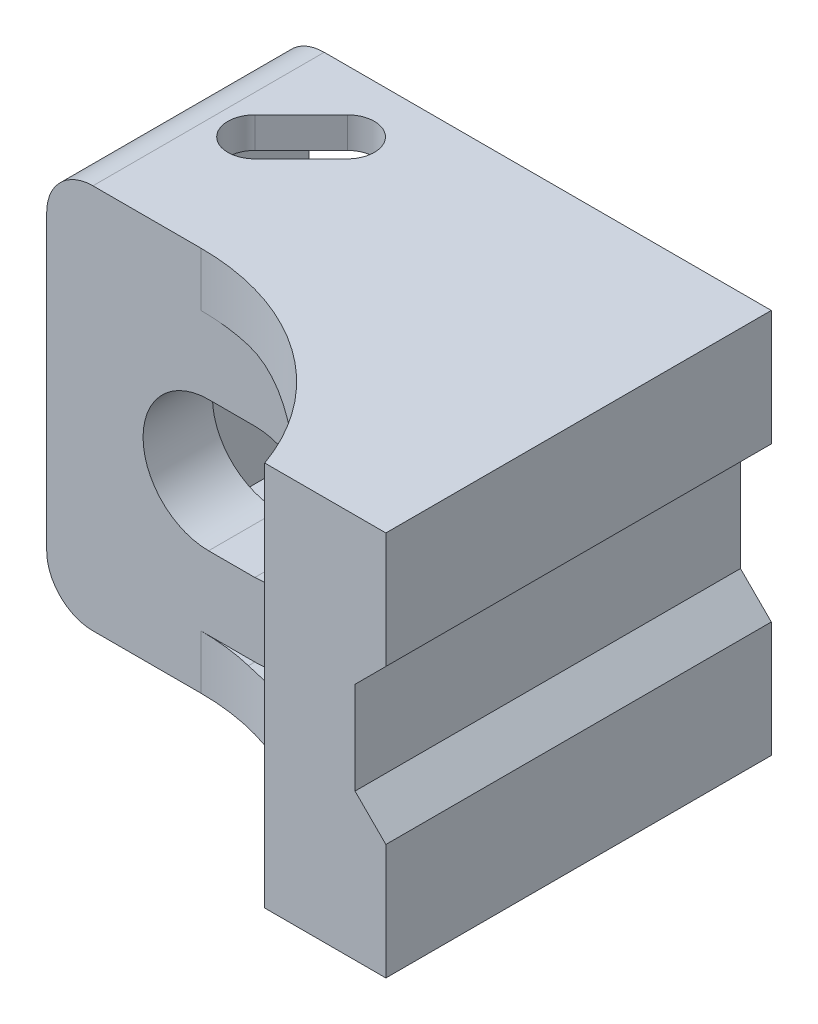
ISO-10303-21;
HEADER;
FILE_DESCRIPTION(('STEP AP214'),'2;1');
FILE_NAME('part.step','',(''),(''),'','','');
FILE_SCHEMA(('AUTOMOTIVE_DESIGN { 1 0 10303 214 1 1 1 1 }'));
ENDSEC;
DATA;
#1=APPLICATION_CONTEXT('core data for automotive mechanical design processes');
#2=APPLICATION_PROTOCOL_DEFINITION('international standard','automotive_design',2000,#1);
#3=PRODUCT_CONTEXT('',#1,'mechanical');
#4=PRODUCT('Part','Part','',(#3));
#5=PRODUCT_RELATED_PRODUCT_CATEGORY('part','',(#4));
#6=PRODUCT_DEFINITION_FORMATION('','',#4);
#7=PRODUCT_DEFINITION_CONTEXT('part definition',#1,'design');
#8=PRODUCT_DEFINITION('design','',#6,#7);
#9=PRODUCT_DEFINITION_SHAPE('','',#8);
#10=(LENGTH_UNIT() NAMED_UNIT(*) SI_UNIT(.MILLI.,.METRE.));
#11=(NAMED_UNIT(*) PLANE_ANGLE_UNIT() SI_UNIT($,.RADIAN.));
#12=(NAMED_UNIT(*) SI_UNIT($,.STERADIAN.) SOLID_ANGLE_UNIT());
#13=UNCERTAINTY_MEASURE_WITH_UNIT(LENGTH_MEASURE(1.E-05),#10,'distance_accuracy_value','');
#14=(GEOMETRIC_REPRESENTATION_CONTEXT(3) GLOBAL_UNCERTAINTY_ASSIGNED_CONTEXT((#13)) GLOBAL_UNIT_ASSIGNED_CONTEXT((#10,
#11,#12)) REPRESENTATION_CONTEXT('',''));
#15=CARTESIAN_POINT('',(0.,0.,0.));
#16=DIRECTION('',(0.,0.,1.));
#17=DIRECTION('',(1.,0.,0.));
#18=AXIS2_PLACEMENT_3D('',#15,#16,#17);
#19=CARTESIAN_POINT('',(18.5,-12.5,25.));
#20=DIRECTION('',(0.,1.,0.));
#21=DIRECTION('',(0.,0.,-1.));
#22=AXIS2_PLACEMENT_3D('',#19,#20,#21);
#23=PLANE('',#22);
#24=DIRECTION('',(1.,0.,0.));
#25=VECTOR('',#24,1.);
#26=CARTESIAN_POINT('',(-3.5,-12.5,15.));
#27=LINE('',#26,#25);
#28=CARTESIAN_POINT('',(-10.5,-12.5,15.));
#29=VERTEX_POINT('',#28);
#30=CARTESIAN_POINT('',(-3.5,-12.5,15.));
#31=VERTEX_POINT('',#30);
#32=EDGE_CURVE('E556',#29,#31,#27,.T.);
#33=ORIENTED_EDGE('',*,*,#32,.F.);
#34=DIRECTION('',(0.,0.,1.));
#35=VECTOR('',#34,1.);
#36=CARTESIAN_POINT('',(-10.5,-12.5,25.));
#37=LINE('',#36,#35);
#38=CARTESIAN_POINT('',(-10.5,-12.5,0.));
#39=VERTEX_POINT('',#38);
#40=EDGE_CURVE('E37',#29,#39,#37,.F.);
#41=ORIENTED_EDGE('',*,*,#40,.T.);
#42=DIRECTION('',(1.,0.,0.));
#43=VECTOR('',#42,1.);
#44=CARTESIAN_POINT('',(18.5,-12.5,0.));
#45=LINE('',#44,#43);
#46=CARTESIAN_POINT('',(18.5,-12.5,0.));
#47=VERTEX_POINT('',#46);
#48=EDGE_CURVE('E523',#39,#47,#45,.T.);
#49=ORIENTED_EDGE('',*,*,#48,.T.);
#50=DIRECTION('',(0.,0.,-1.));
#51=VECTOR('',#50,1.);
#52=CARTESIAN_POINT('',(18.5,-12.5,25.));
#53=LINE('',#52,#51);
#54=CARTESIAN_POINT('',(18.5,-12.5,25.));
#55=VERTEX_POINT('',#54);
#56=EDGE_CURVE('E751',#55,#47,#53,.T.);
#57=ORIENTED_EDGE('',*,*,#56,.F.);
#58=DIRECTION('',(1.,0.,0.));
#59=VECTOR('',#58,1.);
#60=CARTESIAN_POINT('',(18.5,-12.5,25.));
#61=LINE('',#60,#59);
#62=CARTESIAN_POINT('',(10.6421356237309,-12.5,25.));
#63=VERTEX_POINT('',#62);
#64=EDGE_CURVE('E749',#63,#55,#61,.T.);
#65=ORIENTED_EDGE('',*,*,#64,.F.);
#66=CARTESIAN_POINT('',(-3.5,-12.5,30.));
#67=DIRECTION('',(0.,1.,0.));
#68=DIRECTION('',(0.,0.,-1.));
#69=AXIS2_PLACEMENT_3D('',#66,#67,#68);
#70=CIRCLE('',#69,15.);
#71=EDGE_CURVE('E414',#31,#63,#70,.F.);
#72=ORIENTED_EDGE('',*,*,#71,.F.);
#73=EDGE_LOOP('',(#33,#41,#49,#57,#65,#72));
#74=FACE_BOUND('',#73,.T.);
#75=CARTESIAN_POINT('',(-8.,-12.5,7.));
#76=DIRECTION('',(0.,1.,0.));
#77=DIRECTION('',(0.,0.,-1.));
#78=AXIS2_PLACEMENT_3D('',#75,#76,#77);
#79=CIRCLE('',#78,1.75);
#80=CARTESIAN_POINT('',(-9.23743686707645,-12.5,5.76256313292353));
#81=VERTEX_POINT('',#80);
#82=CARTESIAN_POINT('',(-6.76256313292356,-12.5,8.23743686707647));
#83=VERTEX_POINT('',#82);
#84=EDGE_CURVE('E288',#81,#83,#79,.T.);
#85=ORIENTED_EDGE('',*,*,#84,.T.);
#86=DIRECTION('',(0.707106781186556,0.,-0.707106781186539));
#87=VECTOR('',#86,1.);
#88=CARTESIAN_POINT('',(-6.76256313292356,-12.5,8.23743686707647));
#89=LINE('',#88,#87);
#90=CARTESIAN_POINT('',(-3.76256313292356,-12.5,5.23743686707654));
#91=VERTEX_POINT('',#90);
#92=EDGE_CURVE('E294',#83,#91,#89,.T.);
#93=ORIENTED_EDGE('',*,*,#92,.T.);
#94=CARTESIAN_POINT('',(-5.,-12.5,4.00000000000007));
#95=DIRECTION('',(0.,1.,0.));
#96=DIRECTION('',(0.,0.,-1.));
#97=AXIS2_PLACEMENT_3D('',#94,#95,#96);
#98=CIRCLE('',#97,1.75);
#99=CARTESIAN_POINT('',(-6.23743686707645,-12.5,2.76256313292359));
#100=VERTEX_POINT('',#99);
#101=EDGE_CURVE('E314',#91,#100,#98,.T.);
#102=ORIENTED_EDGE('',*,*,#101,.T.);
#103=DIRECTION('',(-0.707106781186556,0.,0.70710678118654));
#104=VECTOR('',#103,1.);
#105=CARTESIAN_POINT('',(-9.23743686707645,-12.5,5.76256313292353));
#106=LINE('',#105,#104);
#107=EDGE_CURVE('E306',#100,#81,#106,.T.);
#108=ORIENTED_EDGE('',*,*,#107,.T.);
#109=EDGE_LOOP('',(#85,#93,#102,#108));
#110=FACE_BOUND('',#109,.T.);
#111=ADVANCED_FACE('F14',(#74,#110),#23,.F.);
#112=CARTESIAN_POINT('',(-11.5,-10.5,0.));
#113=DIRECTION('',(0.,1.,0.));
#114=DIRECTION('',(0.,0.,-1.));
#115=AXIS2_PLACEMENT_3D('',#112,#113,#114);
#116=PLANE('',#115);
#117=DIRECTION('',(-1.,0.,0.));
#118=VECTOR('',#117,1.);
#119=CARTESIAN_POINT('',(-11.5,-10.5,0.));
#120=LINE('',#119,#118);
#121=CARTESIAN_POINT('',(15.727922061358,-10.5,0.));
#122=VERTEX_POINT('',#121);
#123=CARTESIAN_POINT('',(-11.5,-10.5,0.));
#124=VERTEX_POINT('',#123);
#125=EDGE_CURVE('E639',#122,#124,#120,.T.);
#126=ORIENTED_EDGE('',*,*,#125,.T.);
#127=DIRECTION('',(0.,0.,1.));
#128=VECTOR('',#127,1.);
#129=CARTESIAN_POINT('',(-11.5,-10.5,12.));
#130=LINE('',#129,#128);
#131=CARTESIAN_POINT('',(-11.5,-10.5,12.));
#132=VERTEX_POINT('',#131);
#133=EDGE_CURVE('E635',#124,#132,#130,.T.);
#134=ORIENTED_EDGE('',*,*,#133,.T.);
#135=DIRECTION('',(1.,0.,0.));
#136=VECTOR('',#135,1.);
#137=CARTESIAN_POINT('',(-9.,-10.5,12.));
#138=LINE('',#137,#136);
#139=CARTESIAN_POINT('',(-9.,-10.5,12.));
#140=VERTEX_POINT('',#139);
#141=EDGE_CURVE('E638',#132,#140,#138,.T.);
#142=ORIENTED_EDGE('',*,*,#141,.T.);
#143=DIRECTION('',(0.707106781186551,0.,-0.707106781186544));
#144=VECTOR('',#143,1.);
#145=CARTESIAN_POINT('',(-3.,-10.5,6.));
#146=LINE('',#145,#144);
#147=CARTESIAN_POINT('',(-3.,-10.5,6.));
#148=VERTEX_POINT('',#147);
#149=EDGE_CURVE('E656',#140,#148,#146,.T.);
#150=ORIENTED_EDGE('',*,*,#149,.T.);
#151=DIRECTION('',(1.,0.,0.));
#152=VECTOR('',#151,1.);
#153=CARTESIAN_POINT('',(9.72792206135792,-10.5,6.));
#154=LINE('',#153,#152);
#155=CARTESIAN_POINT('',(9.72792206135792,-10.5,6.));
#156=VERTEX_POINT('',#155);
#157=EDGE_CURVE('E659',#148,#156,#154,.T.);
#158=ORIENTED_EDGE('',*,*,#157,.T.);
#159=DIRECTION('',(0.707106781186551,0.,-0.707106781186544));
#160=VECTOR('',#159,1.);
#161=CARTESIAN_POINT('',(15.727922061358,-10.5,0.));
#162=LINE('',#161,#160);
#163=EDGE_CURVE('E661',#156,#122,#162,.T.);
#164=ORIENTED_EDGE('',*,*,#163,.T.);
#165=EDGE_LOOP('',(#126,#134,#142,#150,#158,#164));
#166=FACE_BOUND('',#165,.T.);
#167=DIRECTION('',(-0.707106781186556,0.,0.707106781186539));
#168=VECTOR('',#167,1.);
#169=CARTESIAN_POINT('',(-5.01256313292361,-10.5,6.48743686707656));
#170=LINE('',#169,#168);
#171=CARTESIAN_POINT('',(-3.76256313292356,-10.5,5.23743686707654));
#172=VERTEX_POINT('',#171);
#173=CARTESIAN_POINT('',(-6.76256313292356,-10.5,8.23743686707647));
#174=VERTEX_POINT('',#173);
#175=EDGE_CURVE('E323',#172,#174,#170,.T.);
#176=ORIENTED_EDGE('',*,*,#175,.T.);
#177=CARTESIAN_POINT('',(-8.,-10.5,7.));
#178=DIRECTION('',(0.,1.,0.));
#179=DIRECTION('',(0.,0.,-1.));
#180=AXIS2_PLACEMENT_3D('',#177,#178,#179);
#181=CIRCLE('',#180,1.75);
#182=CARTESIAN_POINT('',(-9.23743686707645,-10.5,5.76256313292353));
#183=VERTEX_POINT('',#182);
#184=EDGE_CURVE('E291',#174,#183,#181,.F.);
#185=ORIENTED_EDGE('',*,*,#184,.T.);
#186=DIRECTION('',(0.707106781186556,0.,-0.70710678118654));
#187=VECTOR('',#186,1.);
#188=CARTESIAN_POINT('',(-7.48743686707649,-10.5,4.01256313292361));
#189=LINE('',#188,#187);
#190=CARTESIAN_POINT('',(-6.23743686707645,-10.5,2.76256313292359));
#191=VERTEX_POINT('',#190);
#192=EDGE_CURVE('E317',#183,#191,#189,.T.);
#193=ORIENTED_EDGE('',*,*,#192,.T.);
#194=CARTESIAN_POINT('',(-5.,-10.5,4.00000000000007));
#195=DIRECTION('',(0.,1.,0.));
#196=DIRECTION('',(0.,0.,-1.));
#197=AXIS2_PLACEMENT_3D('',#194,#195,#196);
#198=CIRCLE('',#197,1.75);
#199=EDGE_CURVE('E320',#191,#172,#198,.F.);
#200=ORIENTED_EDGE('',*,*,#199,.T.);
#201=EDGE_LOOP('',(#176,#185,#193,#200));
#202=FACE_BOUND('',#201,.T.);
#203=ADVANCED_FACE('F486',(#166,#202),#116,.T.);
#204=CARTESIAN_POINT('',(18.5,-12.5,25.));
#205=DIRECTION('',(-1.,0.,0.));
#206=DIRECTION('',(0.,0.,-1.));
#207=AXIS2_PLACEMENT_3D('',#204,#205,#206);
#208=PLANE('',#207);
#209=DIRECTION('',(0.,1.,0.));
#210=VECTOR('',#209,1.);
#211=CARTESIAN_POINT('',(18.5,-12.5,25.));
#212=LINE('',#211,#210);
#213=CARTESIAN_POINT('',(18.5,5.,25.));
#214=VERTEX_POINT('',#213);
#215=CARTESIAN_POINT('',(18.5,12.5,25.));
#216=VERTEX_POINT('',#215);
#217=EDGE_CURVE('E742',#214,#216,#212,.T.);
#218=ORIENTED_EDGE('',*,*,#217,.F.);
#219=DIRECTION('',(0.,0.,1.));
#220=VECTOR('',#219,1.);
#221=CARTESIAN_POINT('',(18.5,5.,-5.00000000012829E-05));
#222=LINE('',#221,#220);
#223=CARTESIAN_POINT('',(18.5,5.,0.));
#224=VERTEX_POINT('',#223);
#225=EDGE_CURVE('E337',#224,#214,#222,.T.);
#226=ORIENTED_EDGE('',*,*,#225,.F.);
#227=DIRECTION('',(0.,1.,0.));
#228=VECTOR('',#227,1.);
#229=CARTESIAN_POINT('',(18.5,-12.5,0.));
#230=LINE('',#229,#228);
#231=CARTESIAN_POINT('',(18.5,12.5,0.));
#232=VERTEX_POINT('',#231);
#233=EDGE_CURVE('E736',#224,#232,#230,.T.);
#234=ORIENTED_EDGE('',*,*,#233,.T.);
#235=DIRECTION('',(0.,0.,-1.));
#236=VECTOR('',#235,1.);
#237=CARTESIAN_POINT('',(18.5,12.5,25.));
#238=LINE('',#237,#236);
#239=EDGE_CURVE('E521',#216,#232,#238,.T.);
#240=ORIENTED_EDGE('',*,*,#239,.F.);
#241=EDGE_LOOP('',(#218,#226,#234,#240));
#242=FACE_BOUND('',#241,.T.);
#243=ADVANCED_FACE('F492',(#242),#208,.F.);
#244=CARTESIAN_POINT('',(0.,0.,10.5));
#245=DIRECTION('',(0.,0.,-1.));
#246=DIRECTION('',(1.,0.,0.));
#247=AXIS2_PLACEMENT_3D('',#244,#245,#246);
#248=CYLINDRICAL_SURFACE('',#247,6.25);
#249=DIRECTION('',(0.,0.,-1.));
#250=VECTOR('',#249,1.);
#251=CARTESIAN_POINT('',(5.,3.75,10.5));
#252=LINE('',#251,#250);
#253=CARTESIAN_POINT('',(5.,3.75,10.5));
#254=VERTEX_POINT('',#253);
#255=CARTESIAN_POINT('',(5.,3.75,6.));
#256=VERTEX_POINT('',#255);
#257=EDGE_CURVE('E399',#254,#256,#252,.T.);
#258=ORIENTED_EDGE('',*,*,#257,.F.);
#259=CARTESIAN_POINT('',(0.,0.,10.5));
#260=DIRECTION('',(0.,0.,-1.));
#261=DIRECTION('',(1.,0.,0.));
#262=AXIS2_PLACEMENT_3D('',#259,#260,#261);
#263=CIRCLE('',#262,6.25);
#264=CARTESIAN_POINT('',(0.,6.25,10.5));
#265=VERTEX_POINT('',#264);
#266=EDGE_CURVE('E687',#265,#254,#263,.T.);
#267=ORIENTED_EDGE('',*,*,#266,.F.);
#268=DIRECTION('',(0.,0.,-1.));
#269=VECTOR('',#268,1.);
#270=CARTESIAN_POINT('',(0.,6.25,10.5));
#271=LINE('',#270,#269);
#272=CARTESIAN_POINT('',(0.,6.25,6.));
#273=VERTEX_POINT('',#272);
#274=EDGE_CURVE('E693',#265,#273,#271,.T.);
#275=ORIENTED_EDGE('',*,*,#274,.T.);
#276=CARTESIAN_POINT('',(0.,0.,6.));
#277=DIRECTION('',(0.,0.,1.));
#278=DIRECTION('',(-1.,0.,0.));
#279=AXIS2_PLACEMENT_3D('',#276,#277,#278);
#280=CIRCLE('',#279,6.25);
#281=EDGE_CURVE('E626',#273,#256,#280,.F.);
#282=ORIENTED_EDGE('',*,*,#281,.T.);
#283=EDGE_LOOP('',(#258,#267,#275,#282));
#284=FACE_BOUND('',#283,.T.);
#285=ADVANCED_FACE('F826',(#284),#248,.F.);
#286=DIRECTION('',(0.,0.,-1.));
#287=VECTOR('',#286,1.);
#288=CARTESIAN_POINT('',(5.,-3.75,10.5));
#289=LINE('',#288,#287);
#290=CARTESIAN_POINT('',(5.,-3.75,6.));
#291=VERTEX_POINT('',#290);
#292=CARTESIAN_POINT('',(5.,-3.75,10.5));
#293=VERTEX_POINT('',#292);
#294=EDGE_CURVE('E395',#291,#293,#289,.F.);
#295=ORIENTED_EDGE('',*,*,#294,.F.);
#296=CARTESIAN_POINT('',(0.,-6.25,6.));
#297=VERTEX_POINT('',#296);
#298=EDGE_CURVE('E619',#291,#297,#280,.F.);
#299=ORIENTED_EDGE('',*,*,#298,.T.);
#300=DIRECTION('',(0.,0.,-1.));
#301=VECTOR('',#300,1.);
#302=CARTESIAN_POINT('',(0.,-6.25,10.5));
#303=LINE('',#302,#301);
#304=CARTESIAN_POINT('',(0.,-6.25,10.5));
#305=VERTEX_POINT('',#304);
#306=EDGE_CURVE('E694',#305,#297,#303,.T.);
#307=ORIENTED_EDGE('',*,*,#306,.F.);
#308=EDGE_CURVE('E686',#293,#305,#263,.T.);
#309=ORIENTED_EDGE('',*,*,#308,.F.);
#310=EDGE_LOOP('',(#295,#299,#307,#309));
#311=FACE_BOUND('',#310,.T.);
#312=ADVANCED_FACE('F806',(#311),#248,.F.);
#313=CARTESIAN_POINT('',(9.72792206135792,-10.5,6.));
#314=DIRECTION('',(0.,0.,1.));
#315=DIRECTION('',(-1.,0.,0.));
#316=AXIS2_PLACEMENT_3D('',#313,#314,#315);
#317=PLANE('',#316);
#318=DIRECTION('',(1.,0.,0.));
#319=VECTOR('',#318,1.);
#320=CARTESIAN_POINT('',(9.72792206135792,3.75,6.));
#321=LINE('',#320,#319);
#322=CARTESIAN_POINT('',(9.72792206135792,3.75,6.));
#323=VERTEX_POINT('',#322);
#324=EDGE_CURVE('E397',#256,#323,#321,.T.);
#325=ORIENTED_EDGE('',*,*,#324,.F.);
#326=ORIENTED_EDGE('',*,*,#281,.F.);
#327=DIRECTION('',(1.,0.,0.));
#328=VECTOR('',#327,1.);
#329=CARTESIAN_POINT('',(-11.5,6.25,6.));
#330=LINE('',#329,#328);
#331=CARTESIAN_POINT('',(-3.,6.25,6.));
#332=VERTEX_POINT('',#331);
#333=EDGE_CURVE('E676',#332,#273,#330,.T.);
#334=ORIENTED_EDGE('',*,*,#333,.F.);
#335=DIRECTION('',(0.,1.,0.));
#336=VECTOR('',#335,1.);
#337=CARTESIAN_POINT('',(-3.,-10.5,6.));
#338=LINE('',#337,#336);
#339=CARTESIAN_POINT('',(-3.,10.5,6.));
#340=VERTEX_POINT('',#339);
#341=EDGE_CURVE('E670',#332,#340,#338,.T.);
#342=ORIENTED_EDGE('',*,*,#341,.T.);
#343=DIRECTION('',(1.,0.,0.));
#344=VECTOR('',#343,1.);
#345=CARTESIAN_POINT('',(9.72792206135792,10.5,6.));
#346=LINE('',#345,#344);
#347=CARTESIAN_POINT('',(9.72792206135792,10.5,6.));
#348=VERTEX_POINT('',#347);
#349=EDGE_CURVE('E646',#340,#348,#346,.T.);
#350=ORIENTED_EDGE('',*,*,#349,.T.);
#351=DIRECTION('',(0.,1.,0.));
#352=VECTOR('',#351,1.);
#353=CARTESIAN_POINT('',(9.72792206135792,-10.5,6.));
#354=LINE('',#353,#352);
#355=EDGE_CURVE('E667',#323,#348,#354,.T.);
#356=ORIENTED_EDGE('',*,*,#355,.F.);
#357=EDGE_LOOP('',(#325,#326,#334,#342,#350,#356));
#358=FACE_BOUND('',#357,.T.);
#359=ADVANCED_FACE('F801',(#358),#317,.F.);
#360=DIRECTION('',(-1.,0.,0.));
#361=VECTOR('',#360,1.);
#362=CARTESIAN_POINT('',(9.72792206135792,-3.75,6.));
#363=LINE('',#362,#361);
#364=CARTESIAN_POINT('',(9.72792206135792,-3.75,6.));
#365=VERTEX_POINT('',#364);
#366=EDGE_CURVE('E393',#365,#291,#363,.T.);
#367=ORIENTED_EDGE('',*,*,#366,.F.);
#368=EDGE_CURVE('E610',#156,#365,#354,.T.);
#369=ORIENTED_EDGE('',*,*,#368,.F.);
#370=ORIENTED_EDGE('',*,*,#157,.F.);
#371=CARTESIAN_POINT('',(-3.,-6.25,6.));
#372=VERTEX_POINT('',#371);
#373=EDGE_CURVE('E668',#148,#372,#338,.T.);
#374=ORIENTED_EDGE('',*,*,#373,.T.);
#375=DIRECTION('',(-1.,0.,0.));
#376=VECTOR('',#375,1.);
#377=CARTESIAN_POINT('',(-11.5,-6.25,6.));
#378=LINE('',#377,#376);
#379=EDGE_CURVE('E622',#297,#372,#378,.T.);
#380=ORIENTED_EDGE('',*,*,#379,.F.);
#381=ORIENTED_EDGE('',*,*,#298,.F.);
#382=EDGE_LOOP('',(#367,#369,#370,#374,#380,#381));
#383=FACE_BOUND('',#382,.T.);
#384=ADVANCED_FACE('F615',(#383),#317,.F.);
#385=CARTESIAN_POINT('',(15.727922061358,-10.5,0.));
#386=DIRECTION('',(0.707106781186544,0.,0.707106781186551));
#387=DIRECTION('',(-0.707106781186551,0.,0.707106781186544));
#388=AXIS2_PLACEMENT_3D('',#385,#386,#387);
#389=PLANE('',#388);
#390=DIRECTION('',(0.707106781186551,0.,-0.707106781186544));
#391=VECTOR('',#390,1.);
#392=CARTESIAN_POINT('',(15.727922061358,3.75,0.));
#393=LINE('',#392,#391);
#394=CARTESIAN_POINT('',(10.,3.75,5.72792206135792));
#395=VERTEX_POINT('',#394);
#396=EDGE_CURVE('E597',#323,#395,#393,.T.);
#397=ORIENTED_EDGE('',*,*,#396,.F.);
#398=ORIENTED_EDGE('',*,*,#355,.T.);
#399=DIRECTION('',(0.707106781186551,0.,-0.707106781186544));
#400=VECTOR('',#399,1.);
#401=CARTESIAN_POINT('',(15.727922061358,10.5,0.));
#402=LINE('',#401,#400);
#403=CARTESIAN_POINT('',(15.727922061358,10.5,0.));
#404=VERTEX_POINT('',#403);
#405=EDGE_CURVE('E642',#348,#404,#402,.T.);
#406=ORIENTED_EDGE('',*,*,#405,.T.);
#407=DIRECTION('',(0.,1.,0.));
#408=VECTOR('',#407,1.);
#409=CARTESIAN_POINT('',(15.727922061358,-10.5,0.));
#410=LINE('',#409,#408);
#411=EDGE_CURVE('E664',#122,#404,#410,.T.);
#412=ORIENTED_EDGE('',*,*,#411,.F.);
#413=ORIENTED_EDGE('',*,*,#163,.F.);
#414=ORIENTED_EDGE('',*,*,#368,.T.);
#415=DIRECTION('',(-0.707106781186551,0.,0.707106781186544));
#416=VECTOR('',#415,1.);
#417=CARTESIAN_POINT('',(15.727922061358,-3.75,0.));
#418=LINE('',#417,#416);
#419=CARTESIAN_POINT('',(10.,-3.75,5.72792206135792));
#420=VERTEX_POINT('',#419);
#421=EDGE_CURVE('E591',#420,#365,#418,.T.);
#422=ORIENTED_EDGE('',*,*,#421,.F.);
#423=CARTESIAN_POINT('',(10.,0.,5.72792206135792));
#424=DIRECTION('',(0.707106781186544,0.,0.707106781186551));
#425=DIRECTION('',(0.707106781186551,0.,-0.707106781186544));
#426=AXIS2_PLACEMENT_3D('',#423,#424,#425);
#427=ELLIPSE('',#426,5.30330085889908,3.75);
#428=EDGE_CURVE('E593',#395,#420,#427,.F.);
#429=ORIENTED_EDGE('',*,*,#428,.F.);
#430=EDGE_LOOP('',(#397,#398,#406,#412,#413,#414,#422,#429));
#431=FACE_BOUND('',#430,.T.);
#432=ADVANCED_FACE('F607',(#431),#389,.F.);
#433=CARTESIAN_POINT('',(18.5,12.5,0.));
#434=DIRECTION('',(0.,0.,1.));
#435=DIRECTION('',(-1.,0.,0.));
#436=AXIS2_PLACEMENT_3D('',#433,#434,#435);
#437=PLANE('',#436);
#438=ORIENTED_EDGE('',*,*,#48,.F.);
#439=CARTESIAN_POINT('',(-10.5,-9.5,0.));
#440=DIRECTION('',(0.,0.,1.));
#441=DIRECTION('',(-1.,0.,0.));
#442=AXIS2_PLACEMENT_3D('',#439,#440,#441);
#443=CIRCLE('',#442,3.);
#444=CARTESIAN_POINT('',(-13.5,-9.5,0.));
#445=VERTEX_POINT('',#444);
#446=EDGE_CURVE('E22',#39,#445,#443,.F.);
#447=ORIENTED_EDGE('',*,*,#446,.T.);
#448=DIRECTION('',(0.,-1.,0.));
#449=VECTOR('',#448,1.);
#450=CARTESIAN_POINT('',(-13.5,12.5,0.));
#451=LINE('',#450,#449);
#452=CARTESIAN_POINT('',(-13.5,9.5,0.));
#453=VERTEX_POINT('',#452);
#454=EDGE_CURVE('E546',#453,#445,#451,.T.);
#455=ORIENTED_EDGE('',*,*,#454,.F.);
#456=CARTESIAN_POINT('',(-10.5,9.5,0.));
#457=DIRECTION('',(0.,0.,1.));
#458=DIRECTION('',(-1.,0.,0.));
#459=AXIS2_PLACEMENT_3D('',#456,#457,#458);
#460=CIRCLE('',#459,3.);
#461=CARTESIAN_POINT('',(-10.5,12.5,0.));
#462=VERTEX_POINT('',#461);
#463=EDGE_CURVE('E29',#453,#462,#460,.F.);
#464=ORIENTED_EDGE('',*,*,#463,.T.);
#465=DIRECTION('',(-1.,0.,0.));
#466=VECTOR('',#465,1.);
#467=CARTESIAN_POINT('',(18.5,12.5,0.));
#468=LINE('',#467,#466);
#469=EDGE_CURVE('E515',#232,#462,#468,.T.);
#470=ORIENTED_EDGE('',*,*,#469,.F.);
#471=ORIENTED_EDGE('',*,*,#233,.F.);
#472=DIRECTION('',(-0.707106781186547,-0.707106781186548,0.));
#473=VECTOR('',#472,1.);
#474=CARTESIAN_POINT('',(22.25,8.75,0.));
#475=LINE('',#474,#473);
#476=CARTESIAN_POINT('',(16.5,3.,0.));
#477=VERTEX_POINT('',#476);
#478=EDGE_CURVE('E346',#224,#477,#475,.T.);
#479=ORIENTED_EDGE('',*,*,#478,.T.);
#480=DIRECTION('',(0.,-1.,0.));
#481=VECTOR('',#480,1.);
#482=CARTESIAN_POINT('',(16.5,12.5,0.));
#483=LINE('',#482,#481);
#484=CARTESIAN_POINT('',(16.5,-3.,0.));
#485=VERTEX_POINT('',#484);
#486=EDGE_CURVE('E349',#477,#485,#483,.T.);
#487=ORIENTED_EDGE('',*,*,#486,.T.);
#488=DIRECTION('',(0.707106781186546,-0.707106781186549,0.));
#489=VECTOR('',#488,1.);
#490=CARTESIAN_POINT('',(9.75,3.75,0.));
#491=LINE('',#490,#489);
#492=CARTESIAN_POINT('',(18.5,-5.,0.));
#493=VERTEX_POINT('',#492);
#494=EDGE_CURVE('E336',#485,#493,#491,.T.);
#495=ORIENTED_EDGE('',*,*,#494,.T.);
#496=EDGE_CURVE('E524',#47,#493,#230,.T.);
#497=ORIENTED_EDGE('',*,*,#496,.F.);
#498=EDGE_LOOP('',(#438,#447,#455,#464,#470,#471,#479,#487,#495,#497));
#499=FACE_BOUND('',#498,.T.);
#500=ORIENTED_EDGE('',*,*,#125,.F.);
#501=ORIENTED_EDGE('',*,*,#411,.T.);
#502=DIRECTION('',(-1.,0.,0.));
#503=VECTOR('',#502,1.);
#504=CARTESIAN_POINT('',(-11.5,10.5,0.));
#505=LINE('',#504,#503);
#506=CARTESIAN_POINT('',(-11.5,10.5,0.));
#507=VERTEX_POINT('',#506);
#508=EDGE_CURVE('E551',#404,#507,#505,.T.);
#509=ORIENTED_EDGE('',*,*,#508,.T.);
#510=DIRECTION('',(0.,-1.,0.));
#511=VECTOR('',#510,1.);
#512=CARTESIAN_POINT('',(-11.5,12.5,0.));
#513=LINE('',#512,#511);
#514=EDGE_CURVE('E552',#507,#124,#513,.T.);
#515=ORIENTED_EDGE('',*,*,#514,.T.);
#516=EDGE_LOOP('',(#500,#501,#509,#515));
#517=FACE_BOUND('',#516,.T.);
#518=ADVANCED_FACE('F544',(#499,#517),#437,.F.);
#519=CARTESIAN_POINT('',(-3.,0.,0.));
#520=DIRECTION('',(0.,0.,1.));
#521=DIRECTION('',(-1.,0.,0.));
#522=AXIS2_PLACEMENT_3D('',#519,#520,#521);
#523=CYLINDRICAL_SURFACE('',#522,4.25);
#524=CARTESIAN_POINT('',(-3.,0.,10.5));
#525=DIRECTION('',(0.,0.,-1.));
#526=DIRECTION('',(1.,0.,0.));
#527=AXIS2_PLACEMENT_3D('',#524,#525,#526);
#528=CIRCLE('',#527,4.25);
#529=CARTESIAN_POINT('',(-3.,4.25,10.5));
#530=VERTEX_POINT('',#529);
#531=CARTESIAN_POINT('',(-3.,-4.25,10.5));
#532=VERTEX_POINT('',#531);
#533=EDGE_CURVE('E702',#530,#532,#528,.F.);
#534=ORIENTED_EDGE('',*,*,#533,.F.);
#535=DIRECTION('',(0.,0.,1.));
#536=VECTOR('',#535,1.);
#537=CARTESIAN_POINT('',(-3.,4.25,0.));
#538=LINE('',#537,#536);
#539=CARTESIAN_POINT('',(-3.,4.25,15.));
#540=VERTEX_POINT('',#539);
#541=EDGE_CURVE('E717',#530,#540,#538,.T.);
#542=ORIENTED_EDGE('',*,*,#541,.T.);
#543=CARTESIAN_POINT('',(-3.,0.,15.));
#544=DIRECTION('',(0.,0.,1.));
#545=DIRECTION('',(1.,0.,0.));
#546=AXIS2_PLACEMENT_3D('',#543,#544,#545);
#547=CIRCLE('',#546,4.25);
#548=CARTESIAN_POINT('',(-3.,-4.25,15.));
#549=VERTEX_POINT('',#548);
#550=EDGE_CURVE('E704',#540,#549,#547,.T.);
#551=ORIENTED_EDGE('',*,*,#550,.T.);
#552=DIRECTION('',(0.,0.,1.));
#553=VECTOR('',#552,1.);
#554=CARTESIAN_POINT('',(-3.,-4.25,0.));
#555=LINE('',#554,#553);
#556=EDGE_CURVE('E716',#532,#549,#555,.T.);
#557=ORIENTED_EDGE('',*,*,#556,.F.);
#558=EDGE_LOOP('',(#534,#542,#551,#557));
#559=FACE_BOUND('',#558,.T.);
#560=ADVANCED_FACE('F788',(#559),#523,.F.);
#561=CARTESIAN_POINT('',(-3.,4.25,0.));
#562=DIRECTION('',(0.,1.,0.));
#563=DIRECTION('',(0.,0.,-1.));
#564=AXIS2_PLACEMENT_3D('',#561,#562,#563);
#565=PLANE('',#564);
#566=DIRECTION('',(-1.,0.,0.));
#567=VECTOR('',#566,1.);
#568=CARTESIAN_POINT('',(-3.,4.25,10.5));
#569=LINE('',#568,#567);
#570=CARTESIAN_POINT('',(0.,4.25,10.5));
#571=VERTEX_POINT('',#570);
#572=EDGE_CURVE('E700',#571,#530,#569,.T.);
#573=ORIENTED_EDGE('',*,*,#572,.F.);
#574=DIRECTION('',(0.,0.,1.));
#575=VECTOR('',#574,1.);
#576=CARTESIAN_POINT('',(0.,4.25,0.));
#577=LINE('',#576,#575);
#578=CARTESIAN_POINT('',(0.,4.25,15.));
#579=VERTEX_POINT('',#578);
#580=EDGE_CURVE('E720',#571,#579,#577,.T.);
#581=ORIENTED_EDGE('',*,*,#580,.T.);
#582=DIRECTION('',(-1.,0.,0.));
#583=VECTOR('',#582,1.);
#584=CARTESIAN_POINT('',(-3.,4.25,15.));
#585=LINE('',#584,#583);
#586=EDGE_CURVE('E713',#579,#540,#585,.T.);
#587=ORIENTED_EDGE('',*,*,#586,.T.);
#588=ORIENTED_EDGE('',*,*,#541,.F.);
#589=EDGE_LOOP('',(#573,#581,#587,#588));
#590=FACE_BOUND('',#589,.T.);
#591=ADVANCED_FACE('F794',(#590),#565,.F.);
#592=CARTESIAN_POINT('',(0.,0.,0.));
#593=DIRECTION('',(0.,0.,1.));
#594=DIRECTION('',(-1.,0.,0.));
#595=AXIS2_PLACEMENT_3D('',#592,#593,#594);
#596=CYLINDRICAL_SURFACE('',#595,4.25);
#597=CARTESIAN_POINT('',(0.,0.,10.5));
#598=DIRECTION('',(0.,0.,-1.));
#599=DIRECTION('',(1.,0.,0.));
#600=AXIS2_PLACEMENT_3D('',#597,#598,#599);
#601=CIRCLE('',#600,4.25);
#602=CARTESIAN_POINT('',(0.,-4.25,10.5));
#603=VERTEX_POINT('',#602);
#604=EDGE_CURVE('E696',#603,#571,#601,.F.);
#605=ORIENTED_EDGE('',*,*,#604,.F.);
#606=DIRECTION('',(0.,0.,1.));
#607=VECTOR('',#606,1.);
#608=CARTESIAN_POINT('',(0.,-4.25,0.));
#609=LINE('',#608,#607);
#610=CARTESIAN_POINT('',(0.,-4.25,15.));
#611=VERTEX_POINT('',#610);
#612=EDGE_CURVE('E722',#603,#611,#609,.T.);
#613=ORIENTED_EDGE('',*,*,#612,.T.);
#614=CARTESIAN_POINT('',(0.,0.,15.));
#615=DIRECTION('',(0.,0.,1.));
#616=DIRECTION('',(-1.,0.,0.));
#617=AXIS2_PLACEMENT_3D('',#614,#615,#616);
#618=CIRCLE('',#617,4.25);
#619=EDGE_CURVE('E710',#611,#579,#618,.T.);
#620=ORIENTED_EDGE('',*,*,#619,.T.);
#621=ORIENTED_EDGE('',*,*,#580,.F.);
#622=EDGE_LOOP('',(#605,#613,#620,#621));
#623=FACE_BOUND('',#622,.T.);
#624=ADVANCED_FACE('F835',(#623),#596,.F.);
#625=CARTESIAN_POINT('',(-3.,-4.25,0.));
#626=DIRECTION('',(0.,-1.,0.));
#627=DIRECTION('',(0.,0.,1.));
#628=AXIS2_PLACEMENT_3D('',#625,#626,#627);
#629=PLANE('',#628);
#630=DIRECTION('',(1.,0.,0.));
#631=VECTOR('',#630,1.);
#632=CARTESIAN_POINT('',(-3.,-4.25,10.5));
#633=LINE('',#632,#631);
#634=EDGE_CURVE('E627',#532,#603,#633,.T.);
#635=ORIENTED_EDGE('',*,*,#634,.F.);
#636=ORIENTED_EDGE('',*,*,#556,.T.);
#637=DIRECTION('',(1.,0.,0.));
#638=VECTOR('',#637,1.);
#639=CARTESIAN_POINT('',(-3.,-4.25,15.));
#640=LINE('',#639,#638);
#641=EDGE_CURVE('E707',#549,#611,#640,.T.);
#642=ORIENTED_EDGE('',*,*,#641,.T.);
#643=ORIENTED_EDGE('',*,*,#612,.F.);
#644=EDGE_LOOP('',(#635,#636,#642,#643));
#645=FACE_BOUND('',#644,.T.);
#646=ADVANCED_FACE('F508',(#645),#629,.F.);
#647=ORIENTED_EDGE('',*,*,#496,.T.);
#648=DIRECTION('',(0.,0.,1.));
#649=VECTOR('',#648,1.);
#650=CARTESIAN_POINT('',(18.5,-5.,-5.00000000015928E-05));
#651=LINE('',#650,#649);
#652=CARTESIAN_POINT('',(18.5,-5.,25.));
#653=VERTEX_POINT('',#652);
#654=EDGE_CURVE('E339',#493,#653,#651,.T.);
#655=ORIENTED_EDGE('',*,*,#654,.T.);
#656=EDGE_CURVE('E743',#55,#653,#212,.T.);
#657=ORIENTED_EDGE('',*,*,#656,.F.);
#658=ORIENTED_EDGE('',*,*,#56,.T.);
#659=EDGE_LOOP('',(#647,#655,#657,#658));
#660=FACE_BOUND('',#659,.T.);
#661=ADVANCED_FACE('F16',(#660),#208,.F.);
#662=CARTESIAN_POINT('',(18.5,12.5,25.));
#663=DIRECTION('',(0.,-1.,0.));
#664=DIRECTION('',(0.,0.,1.));
#665=AXIS2_PLACEMENT_3D('',#662,#663,#664);
#666=PLANE('',#665);
#667=DIRECTION('',(0.707106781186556,0.,-0.707106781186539));
#668=VECTOR('',#667,1.);
#669=CARTESIAN_POINT('',(-6.76256313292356,12.5,8.23743686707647));
#670=LINE('',#669,#668);
#671=CARTESIAN_POINT('',(-6.76256313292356,12.5,8.23743686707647));
#672=VERTEX_POINT('',#671);
#673=CARTESIAN_POINT('',(-3.76256313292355,12.5,5.23743686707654));
#674=VERTEX_POINT('',#673);
#675=EDGE_CURVE('E363',#672,#674,#670,.T.);
#676=ORIENTED_EDGE('',*,*,#675,.F.);
#677=CARTESIAN_POINT('',(-8.,12.5,7.));
#678=DIRECTION('',(0.,1.,0.));
#679=DIRECTION('',(0.,0.,-1.));
#680=AXIS2_PLACEMENT_3D('',#677,#678,#679);
#681=CIRCLE('',#680,1.75);
#682=CARTESIAN_POINT('',(-9.23743686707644,12.5,5.76256313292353));
#683=VERTEX_POINT('',#682);
#684=EDGE_CURVE('E352',#683,#672,#681,.T.);
#685=ORIENTED_EDGE('',*,*,#684,.F.);
#686=DIRECTION('',(-0.707106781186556,0.,0.70710678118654));
#687=VECTOR('',#686,1.);
#688=CARTESIAN_POINT('',(-9.23743686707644,12.5,5.76256313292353));
#689=LINE('',#688,#687);
#690=CARTESIAN_POINT('',(-6.23743686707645,12.5,2.76256313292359));
#691=VERTEX_POINT('',#690);
#692=EDGE_CURVE('E369',#691,#683,#689,.T.);
#693=ORIENTED_EDGE('',*,*,#692,.F.);
#694=CARTESIAN_POINT('',(-5.,12.5,4.00000000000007));
#695=DIRECTION('',(0.,1.,0.));
#696=DIRECTION('',(0.,0.,-1.));
#697=AXIS2_PLACEMENT_3D('',#694,#695,#696);
#698=CIRCLE('',#697,1.75);
#699=EDGE_CURVE('E366',#674,#691,#698,.T.);
#700=ORIENTED_EDGE('',*,*,#699,.F.);
#701=EDGE_LOOP('',(#676,#685,#693,#700));
#702=FACE_BOUND('',#701,.T.);
#703=ORIENTED_EDGE('',*,*,#469,.T.);
#704=DIRECTION('',(0.,0.,-1.));
#705=VECTOR('',#704,1.);
#706=CARTESIAN_POINT('',(-10.5,12.5,25.));
#707=LINE('',#706,#705);
#708=CARTESIAN_POINT('',(-10.5,12.5,15.));
#709=VERTEX_POINT('',#708);
#710=EDGE_CURVE('E9',#462,#709,#707,.F.);
#711=ORIENTED_EDGE('',*,*,#710,.T.);
#712=DIRECTION('',(-1.,0.,0.));
#713=VECTOR('',#712,1.);
#714=CARTESIAN_POINT('',(-3.5,12.5,15.));
#715=LINE('',#714,#713);
#716=CARTESIAN_POINT('',(-3.5,12.5,15.));
#717=VERTEX_POINT('',#716);
#718=EDGE_CURVE('E563',#717,#709,#715,.T.);
#719=ORIENTED_EDGE('',*,*,#718,.F.);
#720=CARTESIAN_POINT('',(-3.5,12.5,30.));
#721=DIRECTION('',(0.,1.,0.));
#722=DIRECTION('',(0.,0.,-1.));
#723=AXIS2_PLACEMENT_3D('',#720,#721,#722);
#724=CIRCLE('',#723,15.);
#725=CARTESIAN_POINT('',(10.6421356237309,12.5,25.));
#726=VERTEX_POINT('',#725);
#727=EDGE_CURVE('E561',#726,#717,#724,.T.);
#728=ORIENTED_EDGE('',*,*,#727,.F.);
#729=DIRECTION('',(-1.,0.,0.));
#730=VECTOR('',#729,1.);
#731=CARTESIAN_POINT('',(18.5,12.5,25.));
#732=LINE('',#731,#730);
#733=EDGE_CURVE('E746',#216,#726,#732,.T.);
#734=ORIENTED_EDGE('',*,*,#733,.F.);
#735=ORIENTED_EDGE('',*,*,#239,.T.);
#736=EDGE_LOOP('',(#703,#711,#719,#728,#734,#735));
#737=FACE_BOUND('',#736,.T.);
#738=ADVANCED_FACE('F498',(#702,#737),#666,.F.);
#739=CARTESIAN_POINT('',(18.5,12.5,25.));
#740=DIRECTION('',(0.,0.,1.));
#741=DIRECTION('',(-1.,0.,0.));
#742=AXIS2_PLACEMENT_3D('',#739,#740,#741);
#743=PLANE('',#742);
#744=DIRECTION('',(-0.707106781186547,-0.707106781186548,0.));
#745=VECTOR('',#744,1.);
#746=CARTESIAN_POINT('',(16.5,3.,25.));
#747=LINE('',#746,#745);
#748=CARTESIAN_POINT('',(16.5,3.,25.));
#749=VERTEX_POINT('',#748);
#750=EDGE_CURVE('E330',#214,#749,#747,.T.);
#751=ORIENTED_EDGE('',*,*,#750,.F.);
#752=ORIENTED_EDGE('',*,*,#217,.T.);
#753=ORIENTED_EDGE('',*,*,#733,.T.);
#754=DIRECTION('',(0.,1.,0.));
#755=VECTOR('',#754,1.);
#756=CARTESIAN_POINT('',(10.6421356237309,-12.501,25.));
#757=LINE('',#756,#755);
#758=EDGE_CURVE('E567',#63,#726,#757,.T.);
#759=ORIENTED_EDGE('',*,*,#758,.F.);
#760=ORIENTED_EDGE('',*,*,#64,.T.);
#761=ORIENTED_EDGE('',*,*,#656,.T.);
#762=DIRECTION('',(0.707106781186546,-0.707106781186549,0.));
#763=VECTOR('',#762,1.);
#764=CARTESIAN_POINT('',(16.5,-3.,25.));
#765=LINE('',#764,#763);
#766=CARTESIAN_POINT('',(16.5,-3.,25.));
#767=VERTEX_POINT('',#766);
#768=EDGE_CURVE('E328',#767,#653,#765,.T.);
#769=ORIENTED_EDGE('',*,*,#768,.F.);
#770=DIRECTION('',(0.,-1.,0.));
#771=VECTOR('',#770,1.);
#772=CARTESIAN_POINT('',(16.5,3.,25.));
#773=LINE('',#772,#771);
#774=EDGE_CURVE('E326',#749,#767,#773,.T.);
#775=ORIENTED_EDGE('',*,*,#774,.F.);
#776=EDGE_LOOP('',(#751,#752,#753,#759,#760,#761,#769,#775));
#777=FACE_BOUND('',#776,.T.);
#778=ADVANCED_FACE('F496',(#777),#743,.T.);
#779=CARTESIAN_POINT('',(0.,0.,15.));
#780=DIRECTION('',(0.,0.,1.));
#781=DIRECTION('',(-1.,0.,0.));
#782=AXIS2_PLACEMENT_3D('',#779,#780,#781);
#783=CYLINDRICAL_SURFACE('',#782,9.);
#784=DIRECTION('',(0.,0.,1.));
#785=VECTOR('',#784,1.);
#786=CARTESIAN_POINT('',(0.,-9.,15.));
#787=LINE('',#786,#785);
#788=CARTESIAN_POINT('',(0.,-9.,15.));
#789=VERTEX_POINT('',#788);
#790=CARTESIAN_POINT('',(0.,-9.,15.4140478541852));
#791=VERTEX_POINT('',#790);
#792=EDGE_CURVE('E733',#789,#791,#787,.T.);
#793=ORIENTED_EDGE('',*,*,#792,.T.);
#794=CARTESIAN_POINT('',(0.,9.,15.4140478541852));
#795=CARTESIAN_POINT('',(0.125029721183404,9.00000100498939,15.4440474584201));
#796=CARTESIAN_POINT('',(0.249650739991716,8.99739413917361,15.4756539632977));
#797=CARTESIAN_POINT('',(0.497829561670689,8.98707897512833,15.5419971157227));
#798=CARTESIAN_POINT('',(0.621387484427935,8.97937125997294,15.576733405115));
#799=CARTESIAN_POINT('',(0.989827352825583,8.94879336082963,15.6854298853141));
#800=CARTESIAN_POINT('',(1.2327953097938,8.91846782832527,15.7639545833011));
#801=CARTESIAN_POINT('',(1.7097783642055,8.83938291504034,15.9315363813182));
#802=CARTESIAN_POINT('',(1.94384788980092,8.79076689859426,16.0205079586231));
#803=CARTESIAN_POINT('',(2.40368367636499,8.67631555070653,16.2084004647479));
#804=CARTESIAN_POINT('',(2.62944791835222,8.61047606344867,16.307323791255));
#805=CARTESIAN_POINT('',(3.07059205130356,8.4631745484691,16.5134748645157));
#806=CARTESIAN_POINT('',(3.28601199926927,8.38178010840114,16.6206655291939));
#807=CARTESIAN_POINT('',(3.70672330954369,8.20440851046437,16.8425042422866));
#808=CARTESIAN_POINT('',(3.91201525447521,8.10843219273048,16.9571518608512));
#809=CARTESIAN_POINT('',(4.31238043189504,7.90279248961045,17.1929395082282));
#810=CARTESIAN_POINT('',(4.5074318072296,7.79310139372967,17.314092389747));
#811=CARTESIAN_POINT('',(4.8865489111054,7.56115294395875,17.5614693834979));
#812=CARTESIAN_POINT('',(5.07061317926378,7.43889392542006,17.687694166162));
#813=CARTESIAN_POINT('',(5.45583172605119,7.1623105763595,17.9643092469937));
#814=CARTESIAN_POINT('',(5.65507065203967,7.00597531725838,18.1153587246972));
#815=CARTESIAN_POINT('',(6.03832941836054,6.67848283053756,18.4206945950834));
#816=CARTESIAN_POINT('',(6.22234702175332,6.50732343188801,18.5749814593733));
#817=CARTESIAN_POINT('',(6.57508698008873,6.15070496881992,18.8847965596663));
#818=CARTESIAN_POINT('',(6.74380110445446,5.96523830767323,19.0403254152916));
#819=CARTESIAN_POINT('',(7.06560003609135,5.58034267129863,19.3502131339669));
#820=CARTESIAN_POINT('',(7.21868733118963,5.38091592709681,19.5045721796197));
#821=CARTESIAN_POINT('',(7.48731690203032,4.99862403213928,19.7867254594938));
#822=CARTESIAN_POINT('',(7.60505811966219,4.81770038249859,19.9150592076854));
#823=CARTESIAN_POINT('',(7.82858277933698,4.44527584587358,20.1668144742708));
#824=CARTESIAN_POINT('',(7.93436480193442,4.25377370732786,20.2902354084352));
#825=CARTESIAN_POINT('',(8.13318126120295,3.86003943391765,20.5293496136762));
#826=CARTESIAN_POINT('',(8.22623482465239,3.65782404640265,20.6450543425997));
#827=CARTESIAN_POINT('',(8.39877614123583,3.24210423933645,20.8655201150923));
#828=CARTESIAN_POINT('',(8.47827065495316,3.02860551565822,20.9702866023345));
#829=CARTESIAN_POINT('',(8.64424329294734,2.52335727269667,21.1941971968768));
#830=CARTESIAN_POINT('',(8.72558188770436,2.22744592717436,21.3081301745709));
#831=CARTESIAN_POINT('',(8.82554295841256,1.77034514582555,21.4510582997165));
#832=CARTESIAN_POINT('',(8.85518105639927,1.61583993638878,21.4940269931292));
#833=CARTESIAN_POINT('',(8.90658954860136,1.30297917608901,21.5691871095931));
#834=CARTESIAN_POINT('',(8.92836419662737,1.14462575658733,21.6013843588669));
#835=CARTESIAN_POINT('',(8.96376054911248,0.823082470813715,21.654000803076));
#836=CARTESIAN_POINT('',(8.97728167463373,0.659857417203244,21.6742745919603));
#837=CARTESIAN_POINT('',(8.99538164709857,0.33179429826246,21.7014634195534));
#838=CARTESIAN_POINT('',(8.99996091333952,0.166956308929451,21.7083790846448));
#839=CARTESIAN_POINT('',(9.00003858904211,-0.162723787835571,21.7084962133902));
#840=CARTESIAN_POINT('',(8.99553707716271,-0.327565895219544,21.7016977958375));
#841=CARTESIAN_POINT('',(8.97758982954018,-0.655647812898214,21.6747366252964));
#842=CARTESIAN_POINT('',(8.96414414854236,-0.818887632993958,21.6545739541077));
#843=CARTESIAN_POINT('',(8.93111299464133,-1.12025190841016,21.6054680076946));
#844=CARTESIAN_POINT('',(8.91261803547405,-1.25875929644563,21.5781017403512));
#845=CARTESIAN_POINT('',(8.86957872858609,-1.53292088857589,21.5150143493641));
#846=CARTESIAN_POINT('',(8.84503229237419,-1.66857409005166,21.4792903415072));
#847=CARTESIAN_POINT('',(8.76284554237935,-2.07058201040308,21.3610292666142));
#848=CARTESIAN_POINT('',(8.69665641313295,-2.33199712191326,21.2674010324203));
#849=CARTESIAN_POINT('',(8.55326577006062,-2.8100934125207,21.0707331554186));
#850=CARTESIAN_POINT('',(8.47823442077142,-3.02844486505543,20.9700475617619));
#851=CARTESIAN_POINT('',(8.31409667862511,-3.45365481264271,20.7563381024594));
#852=CARTESIAN_POINT('',(8.22498087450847,-3.66050549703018,20.6433060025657));
#853=CARTESIAN_POINT('',(8.03350249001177,-4.0635944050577,20.4082652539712));
#854=CARTESIAN_POINT('',(7.93109879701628,-4.25979689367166,20.2862292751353));
#855=CARTESIAN_POINT('',(7.71401387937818,-4.64135187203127,20.0364011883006));
#856=CARTESIAN_POINT('',(7.59933398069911,-4.82670553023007,19.9086097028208));
#857=CARTESIAN_POINT('',(7.31368594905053,-5.2533859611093,19.6017886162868));
#858=CARTESIAN_POINT('',(7.13754796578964,-5.49017002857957,19.4212304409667));
#859=CARTESIAN_POINT('',(6.76374374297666,-5.94460538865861,19.0581746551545));
#860=CARTESIAN_POINT('',(6.56606950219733,-6.16224951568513,18.8756763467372));
#861=CARTESIAN_POINT('',(6.1497085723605,-6.57780495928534,18.5126431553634));
#862=CARTESIAN_POINT('',(5.93103744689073,-6.77573067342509,18.3321069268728));
#863=CARTESIAN_POINT('',(5.47285059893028,-7.15091061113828,17.9761876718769));
#864=CARTESIAN_POINT('',(5.23334192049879,-7.32817177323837,17.8008029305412));
#865=CARTESIAN_POINT('',(4.78201260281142,-7.6282992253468,17.4912812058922));
#866=CARTESIAN_POINT('',(4.57375861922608,-7.75506330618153,17.3557118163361));
#867=CARTESIAN_POINT('',(4.14426682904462,-7.9928264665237,17.0915255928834));
#868=CARTESIAN_POINT('',(3.9230318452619,-8.10382895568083,16.9629072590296));
#869=CARTESIAN_POINT('',(3.4687892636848,-8.30839152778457,16.7145646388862));
#870=CARTESIAN_POINT('',(3.23581710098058,-8.40200053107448,16.5948159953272));
#871=CARTESIAN_POINT('',(2.75844279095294,-8.57059056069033,16.3654131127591));
#872=CARTESIAN_POINT('',(2.51404345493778,-8.64557614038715,16.2557564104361));
#873=CARTESIAN_POINT('',(2.08493143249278,-8.75714240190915,16.0771247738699));
#874=CARTESIAN_POINT('',(1.9026367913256,-8.79859899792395,16.0053478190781));
#875=CARTESIAN_POINT('',(1.5334811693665,-8.87038776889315,15.8683754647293));
#876=CARTESIAN_POINT('',(1.34662151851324,-8.90072314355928,15.8031781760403));
#877=CARTESIAN_POINT('',(0.968174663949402,-8.94981520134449,15.6795538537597));
#878=CARTESIAN_POINT('',(0.776569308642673,-8.96851655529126,15.6211602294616));
#879=CARTESIAN_POINT('',(0.390307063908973,-8.9936213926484,15.5118667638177));
#880=CARTESIAN_POINT('',(0.195648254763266,-9.00001679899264,15.4609718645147));
#881=CARTESIAN_POINT('',(0.,-9.,15.4140478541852));
#882=B_SPLINE_CURVE_WITH_KNOTS('',3,(#794,#795,#796,#797,#798,#799,#800,#801,#802,#803,#804,
#805,#806,#807,#808,#809,#810,#811,#812,#813,#814,#815,#816,#817,#818,#819,#820,#821,#822,#823,
#824,#825,#826,#827,#828,#829,#830,#831,#832,#833,#834,#835,#836,#837,#838,#839,#840,#841,#842,
#843,#844,#845,#846,#847,#848,#849,#850,#851,#852,#853,#854,#855,#856,#857,#858,#859,#860,#861,
#862,#863,#864,#865,#866,#867,#868,#869,#870,#871,#872,#873,#874,#875,#876,#877,#878,#879,#880,
#881),.UNSPECIFIED.,.F.,.F.,(4,2,2,2,2,2,2,2,2,2,2,2,2,2,2,2,2,2,2,2,2,2,2,2,2,2,2,2,2,2,2,2,2,
2,2,2,2,2,2,2,2,2,2,4),(0.,0.385655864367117,0.771267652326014,1.54150808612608,
2.30583292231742,3.07034235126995,3.83160249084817,4.5928187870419,5.35559874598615,
6.11847986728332,7.00227784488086,7.88620547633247,8.77060572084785,9.65486494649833,
10.4077476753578,11.1607196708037,11.9125474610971,12.663999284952,13.6423595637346,
14.1311312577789,14.6196381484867,15.1139850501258,15.6083087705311,16.1026282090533,
16.5969446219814,17.0236906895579,17.4505842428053,18.3043346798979,19.0589825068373,
19.8141367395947,20.5716857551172,21.3291530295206,22.3657395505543,23.4027125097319,
24.4389226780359,25.4747839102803,26.3109001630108,27.1468352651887,27.9803824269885,
28.8137255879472,29.4140635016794,30.0142285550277,30.6172264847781,31.22062006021),.UNSPECIFIED.);
#883=CARTESIAN_POINT('',(0.,9.,15.4140478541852));
#884=VERTEX_POINT('',#883);
#885=EDGE_CURVE('E406',#884,#791,#882,.T.);
#886=ORIENTED_EDGE('',*,*,#885,.F.);
#887=DIRECTION('',(0.,0.,1.));
#888=VECTOR('',#887,1.);
#889=CARTESIAN_POINT('',(0.,9.,15.));
#890=LINE('',#889,#888);
#891=CARTESIAN_POINT('',(0.,9.,15.));
#892=VERTEX_POINT('',#891);
#893=EDGE_CURVE('E732',#892,#884,#890,.T.);
#894=ORIENTED_EDGE('',*,*,#893,.F.);
#895=CARTESIAN_POINT('',(0.,0.,15.));
#896=DIRECTION('',(0.,0.,1.));
#897=DIRECTION('',(-1.,0.,0.));
#898=AXIS2_PLACEMENT_3D('',#895,#896,#897);
#899=CIRCLE('',#898,9.);
#900=EDGE_CURVE('E719',#789,#892,#899,.T.);
#901=ORIENTED_EDGE('',*,*,#900,.F.);
#902=EDGE_LOOP('',(#793,#886,#894,#901));
#903=FACE_BOUND('',#902,.T.);
#904=ADVANCED_FACE('F506',(#903),#783,.F.);
#905=CARTESIAN_POINT('',(0.,-9.,15.));
#906=DIRECTION('',(0.,-1.,0.));
#907=DIRECTION('',(1.,0.,0.));
#908=AXIS2_PLACEMENT_3D('',#905,#906,#907);
#909=PLANE('',#908);
#910=DIRECTION('',(1.,0.,0.));
#911=VECTOR('',#910,1.);
#912=CARTESIAN_POINT('',(0.,-9.,15.));
#913=LINE('',#912,#911);
#914=CARTESIAN_POINT('',(-3.5,-9.,15.));
#915=VERTEX_POINT('',#914);
#916=EDGE_CURVE('E730',#915,#789,#913,.T.);
#917=ORIENTED_EDGE('',*,*,#916,.F.);
#918=CARTESIAN_POINT('',(-3.5,-9.,30.));
#919=DIRECTION('',(0.,-1.,0.));
#920=DIRECTION('',(1.,0.,0.));
#921=AXIS2_PLACEMENT_3D('',#918,#919,#920);
#922=CIRCLE('',#921,15.);
#923=EDGE_CURVE('E403',#791,#915,#922,.F.);
#924=ORIENTED_EDGE('',*,*,#923,.F.);
#925=ORIENTED_EDGE('',*,*,#792,.F.);
#926=EDGE_LOOP('',(#917,#924,#925));
#927=FACE_BOUND('',#926,.T.);
#928=ADVANCED_FACE('F775',(#927),#909,.F.);
#929=CARTESIAN_POINT('',(0.,9.,15.));
#930=DIRECTION('',(0.,1.,0.));
#931=DIRECTION('',(0.,0.,-1.));
#932=AXIS2_PLACEMENT_3D('',#929,#930,#931);
#933=PLANE('',#932);
#934=ORIENTED_EDGE('',*,*,#893,.T.);
#935=CARTESIAN_POINT('',(-3.5,9.,30.));
#936=DIRECTION('',(0.,1.,0.));
#937=DIRECTION('',(0.,0.,-1.));
#938=AXIS2_PLACEMENT_3D('',#935,#936,#937);
#939=CIRCLE('',#938,15.);
#940=CARTESIAN_POINT('',(-3.5,9.,15.));
#941=VERTEX_POINT('',#940);
#942=EDGE_CURVE('E401',#941,#884,#939,.F.);
#943=ORIENTED_EDGE('',*,*,#942,.F.);
#944=DIRECTION('',(-1.,0.,0.));
#945=VECTOR('',#944,1.);
#946=CARTESIAN_POINT('',(0.,9.,15.));
#947=LINE('',#946,#945);
#948=EDGE_CURVE('E727',#892,#941,#947,.T.);
#949=ORIENTED_EDGE('',*,*,#948,.F.);
#950=EDGE_LOOP('',(#934,#943,#949));
#951=FACE_BOUND('',#950,.T.);
#952=ADVANCED_FACE('F768',(#951),#933,.F.);
#953=CARTESIAN_POINT('',(0.,0.,15.));
#954=DIRECTION('',(0.,0.,1.));
#955=DIRECTION('',(-1.,0.,0.));
#956=AXIS2_PLACEMENT_3D('',#953,#954,#955);
#957=PLANE('',#956);
#958=DIRECTION('',(0.,1.,0.));
#959=VECTOR('',#958,1.);
#960=CARTESIAN_POINT('',(-13.5,-12.501,15.));
#961=LINE('',#960,#959);
#962=CARTESIAN_POINT('',(-13.5,-9.5,15.));
#963=VERTEX_POINT('',#962);
#964=CARTESIAN_POINT('',(-13.5,9.5,15.));
#965=VERTEX_POINT('',#964);
#966=EDGE_CURVE('E558',#963,#965,#961,.T.);
#967=ORIENTED_EDGE('',*,*,#966,.F.);
#968=CARTESIAN_POINT('',(-10.5,-9.5,15.));
#969=DIRECTION('',(0.,0.,1.));
#970=DIRECTION('',(-1.,0.,0.));
#971=AXIS2_PLACEMENT_3D('',#968,#969,#970);
#972=CIRCLE('',#971,3.);
#973=EDGE_CURVE('E533',#963,#29,#972,.T.);
#974=ORIENTED_EDGE('',*,*,#973,.T.);
#975=ORIENTED_EDGE('',*,*,#32,.T.);
#976=DIRECTION('',(0.,1.,0.));
#977=VECTOR('',#976,1.);
#978=CARTESIAN_POINT('',(-3.5,-12.501,15.));
#979=LINE('',#978,#977);
#980=EDGE_CURVE('E569',#31,#915,#979,.T.);
#981=ORIENTED_EDGE('',*,*,#980,.T.);
#982=ORIENTED_EDGE('',*,*,#916,.T.);
#983=ORIENTED_EDGE('',*,*,#900,.T.);
#984=ORIENTED_EDGE('',*,*,#948,.T.);
#985=EDGE_CURVE('E570',#941,#717,#979,.T.);
#986=ORIENTED_EDGE('',*,*,#985,.T.);
#987=ORIENTED_EDGE('',*,*,#718,.T.);
#988=CARTESIAN_POINT('',(-10.5,9.5,15.));
#989=DIRECTION('',(0.,0.,1.));
#990=DIRECTION('',(-1.,0.,0.));
#991=AXIS2_PLACEMENT_3D('',#988,#989,#990);
#992=CIRCLE('',#991,3.);
#993=EDGE_CURVE('E528',#709,#965,#992,.T.);
#994=ORIENTED_EDGE('',*,*,#993,.T.);
#995=EDGE_LOOP('',(#967,#974,#975,#981,#982,#983,#984,#986,#987,#994));
#996=FACE_BOUND('',#995,.T.);
#997=ORIENTED_EDGE('',*,*,#550,.F.);
#998=ORIENTED_EDGE('',*,*,#586,.F.);
#999=ORIENTED_EDGE('',*,*,#619,.F.);
#1000=ORIENTED_EDGE('',*,*,#641,.F.);
#1001=EDGE_LOOP('',(#997,#998,#999,#1000));
#1002=FACE_BOUND('',#1001,.T.);
#1003=ADVANCED_FACE('F554',(#996,#1002),#957,.T.);
#1004=CARTESIAN_POINT('',(0.,0.,10.5));
#1005=DIRECTION('',(0.,0.,-1.));
#1006=DIRECTION('',(1.,0.,0.));
#1007=AXIS2_PLACEMENT_3D('',#1004,#1005,#1006);
#1008=PLANE('',#1007);
#1009=ORIENTED_EDGE('',*,*,#604,.T.);
#1010=ORIENTED_EDGE('',*,*,#572,.T.);
#1011=ORIENTED_EDGE('',*,*,#533,.T.);
#1012=ORIENTED_EDGE('',*,*,#634,.T.);
#1013=EDGE_LOOP('',(#1009,#1010,#1011,#1012));
#1014=FACE_BOUND('',#1013,.T.);
#1015=ORIENTED_EDGE('',*,*,#266,.T.);
#1016=DIRECTION('',(-1.,0.,0.));
#1017=VECTOR('',#1016,1.);
#1018=CARTESIAN_POINT('',(10.,3.75,10.5));
#1019=LINE('',#1018,#1017);
#1020=CARTESIAN_POINT('',(10.,3.75,10.5));
#1021=VERTEX_POINT('',#1020);
#1022=EDGE_CURVE('E384',#1021,#254,#1019,.T.);
#1023=ORIENTED_EDGE('',*,*,#1022,.F.);
#1024=CARTESIAN_POINT('',(10.,0.,10.5));
#1025=DIRECTION('',(0.,0.,1.));
#1026=DIRECTION('',(-1.,0.,0.));
#1027=AXIS2_PLACEMENT_3D('',#1024,#1025,#1026);
#1028=CIRCLE('',#1027,3.75);
#1029=CARTESIAN_POINT('',(10.,-3.75,10.5));
#1030=VERTEX_POINT('',#1029);
#1031=EDGE_CURVE('E381',#1030,#1021,#1028,.T.);
#1032=ORIENTED_EDGE('',*,*,#1031,.F.);
#1033=DIRECTION('',(1.,0.,0.));
#1034=VECTOR('',#1033,1.);
#1035=CARTESIAN_POINT('',(10.,-3.75,10.5));
#1036=LINE('',#1035,#1034);
#1037=EDGE_CURVE('E386',#293,#1030,#1036,.T.);
#1038=ORIENTED_EDGE('',*,*,#1037,.F.);
#1039=ORIENTED_EDGE('',*,*,#308,.T.);
#1040=DIRECTION('',(-1.,0.,0.));
#1041=VECTOR('',#1040,1.);
#1042=CARTESIAN_POINT('',(-11.5,-6.25,10.5));
#1043=LINE('',#1042,#1041);
#1044=CARTESIAN_POINT('',(-7.5,-6.25,10.5));
#1045=VERTEX_POINT('',#1044);
#1046=EDGE_CURVE('E690',#305,#1045,#1043,.T.);
#1047=ORIENTED_EDGE('',*,*,#1046,.T.);
#1048=DIRECTION('',(0.,-1.,0.));
#1049=VECTOR('',#1048,1.);
#1050=CARTESIAN_POINT('',(-7.5,0.,10.5));
#1051=LINE('',#1050,#1049);
#1052=CARTESIAN_POINT('',(-7.5,6.25,10.5));
#1053=VERTEX_POINT('',#1052);
#1054=EDGE_CURVE('E679',#1053,#1045,#1051,.T.);
#1055=ORIENTED_EDGE('',*,*,#1054,.F.);
#1056=DIRECTION('',(1.,0.,0.));
#1057=VECTOR('',#1056,1.);
#1058=CARTESIAN_POINT('',(-11.5,6.25,10.5));
#1059=LINE('',#1058,#1057);
#1060=EDGE_CURVE('E684',#1053,#265,#1059,.T.);
#1061=ORIENTED_EDGE('',*,*,#1060,.T.);
#1062=EDGE_LOOP('',(#1015,#1023,#1032,#1038,#1039,#1047,#1055,#1061));
#1063=FACE_BOUND('',#1062,.T.);
#1064=ADVANCED_FACE('F818',(#1014,#1063),#1008,.T.);
#1065=CARTESIAN_POINT('',(-11.5,6.25,10.5));
#1066=DIRECTION('',(0.,1.,0.));
#1067=DIRECTION('',(0.,0.,-1.));
#1068=AXIS2_PLACEMENT_3D('',#1065,#1066,#1067);
#1069=PLANE('',#1068);
#1070=DIRECTION('',(0.707106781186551,0.,-0.707106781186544));
#1071=VECTOR('',#1070,1.);
#1072=CARTESIAN_POINT('',(-9.5,6.25,12.5));
#1073=LINE('',#1072,#1071);
#1074=EDGE_CURVE('E681',#1053,#332,#1073,.T.);
#1075=ORIENTED_EDGE('',*,*,#1074,.T.);
#1076=ORIENTED_EDGE('',*,*,#333,.T.);
#1077=ORIENTED_EDGE('',*,*,#274,.F.);
#1078=ORIENTED_EDGE('',*,*,#1060,.F.);
#1079=EDGE_LOOP('',(#1075,#1076,#1077,#1078));
#1080=FACE_BOUND('',#1079,.T.);
#1081=ADVANCED_FACE('F821',(#1080),#1069,.F.);
#1082=CARTESIAN_POINT('',(-11.5,-6.25,10.5));
#1083=DIRECTION('',(0.,-1.,0.));
#1084=DIRECTION('',(1.,0.,0.));
#1085=AXIS2_PLACEMENT_3D('',#1082,#1083,#1084);
#1086=PLANE('',#1085);
#1087=ORIENTED_EDGE('',*,*,#306,.T.);
#1088=ORIENTED_EDGE('',*,*,#379,.T.);
#1089=DIRECTION('',(-0.707106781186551,0.,0.707106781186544));
#1090=VECTOR('',#1089,1.);
#1091=CARTESIAN_POINT('',(-9.5,-6.25,12.5));
#1092=LINE('',#1091,#1090);
#1093=EDGE_CURVE('E594',#372,#1045,#1092,.T.);
#1094=ORIENTED_EDGE('',*,*,#1093,.T.);
#1095=ORIENTED_EDGE('',*,*,#1046,.F.);
#1096=EDGE_LOOP('',(#1087,#1088,#1094,#1095));
#1097=FACE_BOUND('',#1096,.T.);
#1098=ADVANCED_FACE('F812',(#1097),#1086,.F.);
#1099=CARTESIAN_POINT('',(-3.,-10.5,6.));
#1100=DIRECTION('',(0.707106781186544,0.,0.707106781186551));
#1101=DIRECTION('',(-0.707106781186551,0.,0.707106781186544));
#1102=AXIS2_PLACEMENT_3D('',#1099,#1100,#1101);
#1103=PLANE('',#1102);
#1104=ORIENTED_EDGE('',*,*,#1054,.T.);
#1105=ORIENTED_EDGE('',*,*,#1093,.F.);
#1106=ORIENTED_EDGE('',*,*,#373,.F.);
#1107=ORIENTED_EDGE('',*,*,#149,.F.);
#1108=DIRECTION('',(0.,1.,0.));
#1109=VECTOR('',#1108,1.);
#1110=CARTESIAN_POINT('',(-9.,-10.5,12.));
#1111=LINE('',#1110,#1109);
#1112=CARTESIAN_POINT('',(-9.,10.5,12.));
#1113=VERTEX_POINT('',#1112);
#1114=EDGE_CURVE('E671',#140,#1113,#1111,.T.);
#1115=ORIENTED_EDGE('',*,*,#1114,.T.);
#1116=DIRECTION('',(0.707106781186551,0.,-0.707106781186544));
#1117=VECTOR('',#1116,1.);
#1118=CARTESIAN_POINT('',(-3.,10.5,6.));
#1119=LINE('',#1118,#1117);
#1120=EDGE_CURVE('E651',#1113,#340,#1119,.T.);
#1121=ORIENTED_EDGE('',*,*,#1120,.T.);
#1122=ORIENTED_EDGE('',*,*,#341,.F.);
#1123=ORIENTED_EDGE('',*,*,#1074,.F.);
#1124=EDGE_LOOP('',(#1104,#1105,#1106,#1107,#1115,#1121,#1122,#1123));
#1125=FACE_BOUND('',#1124,.T.);
#1126=ADVANCED_FACE('F808',(#1125),#1103,.F.);
#1127=CARTESIAN_POINT('',(-9.,-10.5,12.));
#1128=DIRECTION('',(0.,0.,1.));
#1129=DIRECTION('',(-1.,0.,0.));
#1130=AXIS2_PLACEMENT_3D('',#1127,#1128,#1129);
#1131=PLANE('',#1130);
#1132=DIRECTION('',(1.,0.,0.));
#1133=VECTOR('',#1132,1.);
#1134=CARTESIAN_POINT('',(-9.,10.5,12.));
#1135=LINE('',#1134,#1133);
#1136=CARTESIAN_POINT('',(-11.5,10.5,12.));
#1137=VERTEX_POINT('',#1136);
#1138=EDGE_CURVE('E579',#1137,#1113,#1135,.T.);
#1139=ORIENTED_EDGE('',*,*,#1138,.T.);
#1140=ORIENTED_EDGE('',*,*,#1114,.F.);
#1141=ORIENTED_EDGE('',*,*,#141,.F.);
#1142=DIRECTION('',(0.,1.,0.));
#1143=VECTOR('',#1142,1.);
#1144=CARTESIAN_POINT('',(-11.5,-10.5,12.));
#1145=LINE('',#1144,#1143);
#1146=EDGE_CURVE('E663',#132,#1137,#1145,.T.);
#1147=ORIENTED_EDGE('',*,*,#1146,.T.);
#1148=EDGE_LOOP('',(#1139,#1140,#1141,#1147));
#1149=FACE_BOUND('',#1148,.T.);
#1150=ADVANCED_FACE('F811',(#1149),#1131,.F.);
#1151=CARTESIAN_POINT('',(-11.5,10.5,0.));
#1152=DIRECTION('',(0.,1.,0.));
#1153=DIRECTION('',(0.,0.,-1.));
#1154=AXIS2_PLACEMENT_3D('',#1151,#1152,#1153);
#1155=PLANE('',#1154);
#1156=DIRECTION('',(0.707106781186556,0.,-0.70710678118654));
#1157=VECTOR('',#1156,1.);
#1158=CARTESIAN_POINT('',(-9.23743686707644,10.5,5.76256313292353));
#1159=LINE('',#1158,#1157);
#1160=CARTESIAN_POINT('',(-9.23743686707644,10.5,5.76256313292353));
#1161=VERTEX_POINT('',#1160);
#1162=CARTESIAN_POINT('',(-6.23743686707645,10.5,2.76256313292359));
#1163=VERTEX_POINT('',#1162);
#1164=EDGE_CURVE('E356',#1161,#1163,#1159,.T.);
#1165=ORIENTED_EDGE('',*,*,#1164,.F.);
#1166=CARTESIAN_POINT('',(-8.,10.5,7.));
#1167=DIRECTION('',(0.,1.,0.));
#1168=DIRECTION('',(0.,0.,-1.));
#1169=AXIS2_PLACEMENT_3D('',#1166,#1167,#1168);
#1170=CIRCLE('',#1169,1.75);
#1171=CARTESIAN_POINT('',(-6.76256313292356,10.5,8.23743686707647));
#1172=VERTEX_POINT('',#1171);
#1173=EDGE_CURVE('E359',#1172,#1161,#1170,.F.);
#1174=ORIENTED_EDGE('',*,*,#1173,.F.);
#1175=DIRECTION('',(-0.707106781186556,0.,0.707106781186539));
#1176=VECTOR('',#1175,1.);
#1177=CARTESIAN_POINT('',(-6.76256313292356,10.5,8.23743686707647));
#1178=LINE('',#1177,#1176);
#1179=CARTESIAN_POINT('',(-3.76256313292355,10.5,5.23743686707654));
#1180=VERTEX_POINT('',#1179);
#1181=EDGE_CURVE('E361',#1180,#1172,#1178,.T.);
#1182=ORIENTED_EDGE('',*,*,#1181,.F.);
#1183=CARTESIAN_POINT('',(-5.,10.5,4.00000000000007));
#1184=DIRECTION('',(0.,1.,0.));
#1185=DIRECTION('',(0.,0.,-1.));
#1186=AXIS2_PLACEMENT_3D('',#1183,#1184,#1185);
#1187=CIRCLE('',#1186,1.75);
#1188=EDGE_CURVE('E353',#1163,#1180,#1187,.F.);
#1189=ORIENTED_EDGE('',*,*,#1188,.F.);
#1190=EDGE_LOOP('',(#1165,#1174,#1182,#1189));
#1191=FACE_BOUND('',#1190,.T.);
#1192=ORIENTED_EDGE('',*,*,#508,.F.);
#1193=ORIENTED_EDGE('',*,*,#405,.F.);
#1194=ORIENTED_EDGE('',*,*,#349,.F.);
#1195=ORIENTED_EDGE('',*,*,#1120,.F.);
#1196=ORIENTED_EDGE('',*,*,#1138,.F.);
#1197=DIRECTION('',(0.,0.,1.));
#1198=VECTOR('',#1197,1.);
#1199=CARTESIAN_POINT('',(-11.5,10.5,12.));
#1200=LINE('',#1199,#1198);
#1201=EDGE_CURVE('E582',#507,#1137,#1200,.T.);
#1202=ORIENTED_EDGE('',*,*,#1201,.F.);
#1203=EDGE_LOOP('',(#1192,#1193,#1194,#1195,#1196,#1202));
#1204=FACE_BOUND('',#1203,.T.);
#1205=ADVANCED_FACE('F816',(#1191,#1204),#1155,.F.);
#1206=CARTESIAN_POINT('',(-11.5,-12.5,25.));
#1207=DIRECTION('',(1.,0.,0.));
#1208=DIRECTION('',(0.,0.,1.));
#1209=AXIS2_PLACEMENT_3D('',#1206,#1207,#1208);
#1210=PLANE('',#1209);
#1211=ORIENTED_EDGE('',*,*,#133,.F.);
#1212=ORIENTED_EDGE('',*,*,#514,.F.);
#1213=ORIENTED_EDGE('',*,*,#1201,.T.);
#1214=ORIENTED_EDGE('',*,*,#1146,.F.);
#1215=EDGE_LOOP('',(#1211,#1212,#1213,#1214));
#1216=FACE_BOUND('',#1215,.T.);
#1217=ADVANCED_FACE('F878',(#1216),#1210,.T.);
#1218=CARTESIAN_POINT('',(-13.5,-12.5,25.));
#1219=DIRECTION('',(1.,0.,0.));
#1220=DIRECTION('',(0.,0.,1.));
#1221=AXIS2_PLACEMENT_3D('',#1218,#1219,#1220);
#1222=PLANE('',#1221);
#1223=ORIENTED_EDGE('',*,*,#454,.T.);
#1224=DIRECTION('',(0.,0.,1.));
#1225=VECTOR('',#1224,1.);
#1226=CARTESIAN_POINT('',(-13.5,-9.5,25.));
#1227=LINE('',#1226,#1225);
#1228=EDGE_CURVE('E534',#445,#963,#1227,.T.);
#1229=ORIENTED_EDGE('',*,*,#1228,.T.);
#1230=ORIENTED_EDGE('',*,*,#966,.T.);
#1231=DIRECTION('',(0.,0.,-1.));
#1232=VECTOR('',#1231,1.);
#1233=CARTESIAN_POINT('',(-13.5,9.5,25.));
#1234=LINE('',#1233,#1232);
#1235=EDGE_CURVE('E529',#965,#453,#1234,.T.);
#1236=ORIENTED_EDGE('',*,*,#1235,.T.);
#1237=EDGE_LOOP('',(#1223,#1229,#1230,#1236));
#1238=FACE_BOUND('',#1237,.T.);
#1239=ADVANCED_FACE('F550',(#1238),#1222,.F.);
#1240=CARTESIAN_POINT('',(-3.5,-12.501,30.));
#1241=DIRECTION('',(0.,1.,0.));
#1242=DIRECTION('',(0.,0.,-1.));
#1243=AXIS2_PLACEMENT_3D('',#1240,#1241,#1242);
#1244=CYLINDRICAL_SURFACE('',#1243,15.);
#1245=ORIENTED_EDGE('',*,*,#71,.T.);
#1246=ORIENTED_EDGE('',*,*,#758,.T.);
#1247=ORIENTED_EDGE('',*,*,#727,.T.);
#1248=ORIENTED_EDGE('',*,*,#985,.F.);
#1249=ORIENTED_EDGE('',*,*,#942,.T.);
#1250=ORIENTED_EDGE('',*,*,#885,.T.);
#1251=ORIENTED_EDGE('',*,*,#923,.T.);
#1252=ORIENTED_EDGE('',*,*,#980,.F.);
#1253=EDGE_LOOP('',(#1245,#1246,#1247,#1248,#1249,#1250,#1251,#1252));
#1254=FACE_BOUND('',#1253,.T.);
#1255=ADVANCED_FACE('F416',(#1254),#1244,.F.);
#1256=CARTESIAN_POINT('',(10.,0.,10.5));
#1257=DIRECTION('',(0.,0.,-1.));
#1258=DIRECTION('',(1.,0.,0.));
#1259=AXIS2_PLACEMENT_3D('',#1256,#1257,#1258);
#1260=CYLINDRICAL_SURFACE('',#1259,3.75);
#1261=ORIENTED_EDGE('',*,*,#428,.T.);
#1262=DIRECTION('',(0.,0.,-1.));
#1263=VECTOR('',#1262,1.);
#1264=CARTESIAN_POINT('',(10.,-3.75,10.5));
#1265=LINE('',#1264,#1263);
#1266=EDGE_CURVE('E388',#1030,#420,#1265,.T.);
#1267=ORIENTED_EDGE('',*,*,#1266,.F.);
#1268=ORIENTED_EDGE('',*,*,#1031,.T.);
#1269=DIRECTION('',(0.,0.,-1.));
#1270=VECTOR('',#1269,1.);
#1271=CARTESIAN_POINT('',(10.,3.75,10.5));
#1272=LINE('',#1271,#1270);
#1273=EDGE_CURVE('E390',#1021,#395,#1272,.T.);
#1274=ORIENTED_EDGE('',*,*,#1273,.T.);
#1275=EDGE_LOOP('',(#1261,#1267,#1268,#1274));
#1276=FACE_BOUND('',#1275,.T.);
#1277=ADVANCED_FACE('F421',(#1276),#1260,.F.);
#1278=CARTESIAN_POINT('',(10.,3.75,10.5));
#1279=DIRECTION('',(0.,-1.,0.));
#1280=DIRECTION('',(0.,0.,1.));
#1281=AXIS2_PLACEMENT_3D('',#1278,#1279,#1280);
#1282=PLANE('',#1281);
#1283=ORIENTED_EDGE('',*,*,#257,.T.);
#1284=ORIENTED_EDGE('',*,*,#324,.T.);
#1285=ORIENTED_EDGE('',*,*,#396,.T.);
#1286=ORIENTED_EDGE('',*,*,#1273,.F.);
#1287=ORIENTED_EDGE('',*,*,#1022,.T.);
#1288=EDGE_LOOP('',(#1283,#1284,#1285,#1286,#1287));
#1289=FACE_BOUND('',#1288,.T.);
#1290=ADVANCED_FACE('F424',(#1289),#1282,.T.);
#1291=CARTESIAN_POINT('',(10.,-3.75,10.5));
#1292=DIRECTION('',(0.,1.,0.));
#1293=DIRECTION('',(0.,0.,-1.));
#1294=AXIS2_PLACEMENT_3D('',#1291,#1292,#1293);
#1295=PLANE('',#1294);
#1296=ORIENTED_EDGE('',*,*,#294,.T.);
#1297=ORIENTED_EDGE('',*,*,#1037,.T.);
#1298=ORIENTED_EDGE('',*,*,#1266,.T.);
#1299=ORIENTED_EDGE('',*,*,#421,.T.);
#1300=ORIENTED_EDGE('',*,*,#366,.T.);
#1301=EDGE_LOOP('',(#1296,#1297,#1298,#1299,#1300));
#1302=FACE_BOUND('',#1301,.T.);
#1303=ADVANCED_FACE('F428',(#1302),#1295,.T.);
#1304=CARTESIAN_POINT('',(-8.,1.30761184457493,7.));
#1305=DIRECTION('',(0.,1.,0.));
#1306=DIRECTION('',(0.,0.,-1.));
#1307=AXIS2_PLACEMENT_3D('',#1304,#1305,#1306);
#1308=CYLINDRICAL_SURFACE('',#1307,1.75);
#1309=ORIENTED_EDGE('',*,*,#1173,.T.);
#1310=DIRECTION('',(0.,1.,0.));
#1311=VECTOR('',#1310,1.);
#1312=CARTESIAN_POINT('',(-9.23743686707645,1.30761184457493,5.76256313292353));
#1313=LINE('',#1312,#1311);
#1314=EDGE_CURVE('E357',#1161,#683,#1313,.T.);
#1315=ORIENTED_EDGE('',*,*,#1314,.T.);
#1316=ORIENTED_EDGE('',*,*,#684,.T.);
#1317=DIRECTION('',(0.,1.,0.));
#1318=VECTOR('',#1317,1.);
#1319=CARTESIAN_POINT('',(-6.76256313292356,1.30761184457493,8.23743686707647));
#1320=LINE('',#1319,#1318);
#1321=EDGE_CURVE('E372',#1172,#672,#1320,.T.);
#1322=ORIENTED_EDGE('',*,*,#1321,.F.);
#1323=EDGE_LOOP('',(#1309,#1315,#1316,#1322));
#1324=FACE_BOUND('',#1323,.T.);
#1325=ADVANCED_FACE('F432',(#1324),#1308,.F.);
#1326=CARTESIAN_POINT('',(-9.23743686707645,1.30761184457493,5.76256313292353));
#1327=DIRECTION('',(-0.707106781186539,0.,-0.707106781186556));
#1328=DIRECTION('',(0.707106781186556,0.,-0.70710678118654));
#1329=AXIS2_PLACEMENT_3D('',#1326,#1327,#1328);
#1330=PLANE('',#1329);
#1331=ORIENTED_EDGE('',*,*,#1164,.T.);
#1332=DIRECTION('',(0.,1.,0.));
#1333=VECTOR('',#1332,1.);
#1334=CARTESIAN_POINT('',(-6.23743686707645,1.30761184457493,2.76256313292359));
#1335=LINE('',#1334,#1333);
#1336=EDGE_CURVE('E374',#1163,#691,#1335,.T.);
#1337=ORIENTED_EDGE('',*,*,#1336,.T.);
#1338=ORIENTED_EDGE('',*,*,#692,.T.);
#1339=ORIENTED_EDGE('',*,*,#1314,.F.);
#1340=EDGE_LOOP('',(#1331,#1337,#1338,#1339));
#1341=FACE_BOUND('',#1340,.T.);
#1342=ADVANCED_FACE('F436',(#1341),#1330,.F.);
#1343=CARTESIAN_POINT('',(-5.,1.30761184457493,4.00000000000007));
#1344=DIRECTION('',(0.,1.,0.));
#1345=DIRECTION('',(0.,0.,-1.));
#1346=AXIS2_PLACEMENT_3D('',#1343,#1344,#1345);
#1347=CYLINDRICAL_SURFACE('',#1346,1.75);
#1348=ORIENTED_EDGE('',*,*,#1188,.T.);
#1349=DIRECTION('',(0.,1.,0.));
#1350=VECTOR('',#1349,1.);
#1351=CARTESIAN_POINT('',(-3.76256313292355,1.30761184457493,5.23743686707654));
#1352=LINE('',#1351,#1350);
#1353=EDGE_CURVE('E376',#1180,#674,#1352,.T.);
#1354=ORIENTED_EDGE('',*,*,#1353,.T.);
#1355=ORIENTED_EDGE('',*,*,#699,.T.);
#1356=ORIENTED_EDGE('',*,*,#1336,.F.);
#1357=EDGE_LOOP('',(#1348,#1354,#1355,#1356));
#1358=FACE_BOUND('',#1357,.T.);
#1359=ADVANCED_FACE('F442',(#1358),#1347,.F.);
#1360=CARTESIAN_POINT('',(-6.76256313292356,1.30761184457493,8.23743686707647));
#1361=DIRECTION('',(0.707106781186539,0.,0.707106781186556));
#1362=DIRECTION('',(-0.707106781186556,0.,0.707106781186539));
#1363=AXIS2_PLACEMENT_3D('',#1360,#1361,#1362);
#1364=PLANE('',#1363);
#1365=ORIENTED_EDGE('',*,*,#1181,.T.);
#1366=ORIENTED_EDGE('',*,*,#1321,.T.);
#1367=ORIENTED_EDGE('',*,*,#675,.T.);
#1368=ORIENTED_EDGE('',*,*,#1353,.F.);
#1369=EDGE_LOOP('',(#1365,#1366,#1367,#1368));
#1370=FACE_BOUND('',#1369,.T.);
#1371=ADVANCED_FACE('F438',(#1370),#1364,.F.);
#1372=CARTESIAN_POINT('',(16.5,3.,-5.00000000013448E-05));
#1373=DIRECTION('',(-1.,0.,0.));
#1374=DIRECTION('',(0.,0.,-1.));
#1375=AXIS2_PLACEMENT_3D('',#1372,#1373,#1374);
#1376=PLANE('',#1375);
#1377=DIRECTION('',(0.,0.,1.));
#1378=VECTOR('',#1377,1.);
#1379=CARTESIAN_POINT('',(16.5,3.,-5.00000000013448E-05));
#1380=LINE('',#1379,#1378);
#1381=EDGE_CURVE('E334',#477,#749,#1380,.T.);
#1382=ORIENTED_EDGE('',*,*,#1381,.T.);
#1383=ORIENTED_EDGE('',*,*,#774,.T.);
#1384=DIRECTION('',(0.,0.,1.));
#1385=VECTOR('',#1384,1.);
#1386=CARTESIAN_POINT('',(16.5,-3.,-5.00000000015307E-05));
#1387=LINE('',#1386,#1385);
#1388=EDGE_CURVE('E333',#485,#767,#1387,.T.);
#1389=ORIENTED_EDGE('',*,*,#1388,.F.);
#1390=ORIENTED_EDGE('',*,*,#486,.F.);
#1391=EDGE_LOOP('',(#1382,#1383,#1389,#1390));
#1392=FACE_BOUND('',#1391,.T.);
#1393=ADVANCED_FACE('F441',(#1392),#1376,.F.);
#1394=CARTESIAN_POINT('',(16.5,3.,-5.00000000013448E-05));
#1395=DIRECTION('',(-0.707106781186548,0.707106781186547,0.));
#1396=DIRECTION('',(-0.707106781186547,-0.707106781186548,0.));
#1397=AXIS2_PLACEMENT_3D('',#1394,#1395,#1396);
#1398=PLANE('',#1397);
#1399=ORIENTED_EDGE('',*,*,#225,.T.);
#1400=ORIENTED_EDGE('',*,*,#750,.T.);
#1401=ORIENTED_EDGE('',*,*,#1381,.F.);
#1402=ORIENTED_EDGE('',*,*,#478,.F.);
#1403=EDGE_LOOP('',(#1399,#1400,#1401,#1402));
#1404=FACE_BOUND('',#1403,.T.);
#1405=ADVANCED_FACE('F452',(#1404),#1398,.F.);
#1406=CARTESIAN_POINT('',(16.5,-3.,-5.00000000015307E-05));
#1407=DIRECTION('',(-0.707106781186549,-0.707106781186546,0.));
#1408=DIRECTION('',(0.707106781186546,-0.707106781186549,0.));
#1409=AXIS2_PLACEMENT_3D('',#1406,#1407,#1408);
#1410=PLANE('',#1409);
#1411=ORIENTED_EDGE('',*,*,#1388,.T.);
#1412=ORIENTED_EDGE('',*,*,#768,.T.);
#1413=ORIENTED_EDGE('',*,*,#654,.F.);
#1414=ORIENTED_EDGE('',*,*,#494,.F.);
#1415=EDGE_LOOP('',(#1411,#1412,#1413,#1414));
#1416=FACE_BOUND('',#1415,.T.);
#1417=ADVANCED_FACE('F454',(#1416),#1410,.F.);
#1418=CARTESIAN_POINT('',(-8.,19.692388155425,7.));
#1419=DIRECTION('',(0.,-1.,0.));
#1420=DIRECTION('',(0.,0.,1.));
#1421=AXIS2_PLACEMENT_3D('',#1418,#1419,#1420);
#1422=CYLINDRICAL_SURFACE('',#1421,1.75);
#1423=DIRECTION('',(0.,-1.,0.));
#1424=VECTOR('',#1423,1.);
#1425=CARTESIAN_POINT('',(-6.76256313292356,19.692388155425,8.23743686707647));
#1426=LINE('',#1425,#1424);
#1427=EDGE_CURVE('E283',#174,#83,#1426,.T.);
#1428=ORIENTED_EDGE('',*,*,#1427,.T.);
#1429=ORIENTED_EDGE('',*,*,#84,.F.);
#1430=DIRECTION('',(0.,-1.,0.));
#1431=VECTOR('',#1430,1.);
#1432=CARTESIAN_POINT('',(-9.23743686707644,19.692388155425,5.76256313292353));
#1433=LINE('',#1432,#1431);
#1434=EDGE_CURVE('E307',#183,#81,#1433,.T.);
#1435=ORIENTED_EDGE('',*,*,#1434,.F.);
#1436=ORIENTED_EDGE('',*,*,#184,.F.);
#1437=EDGE_LOOP('',(#1428,#1429,#1435,#1436));
#1438=FACE_BOUND('',#1437,.T.);
#1439=ADVANCED_FACE('F285',(#1438),#1422,.F.);
#1440=CARTESIAN_POINT('',(-6.76256313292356,19.692388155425,8.23743686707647));
#1441=DIRECTION('',(-0.707106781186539,0.,-0.707106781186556));
#1442=DIRECTION('',(0.707106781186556,0.,-0.707106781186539));
#1443=AXIS2_PLACEMENT_3D('',#1440,#1441,#1442);
#1444=PLANE('',#1443);
#1445=DIRECTION('',(0.,-1.,0.));
#1446=VECTOR('',#1445,1.);
#1447=CARTESIAN_POINT('',(-3.76256313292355,19.692388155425,5.23743686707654));
#1448=LINE('',#1447,#1446);
#1449=EDGE_CURVE('E299',#172,#91,#1448,.T.);
#1450=ORIENTED_EDGE('',*,*,#1449,.T.);
#1451=ORIENTED_EDGE('',*,*,#92,.F.);
#1452=ORIENTED_EDGE('',*,*,#1427,.F.);
#1453=ORIENTED_EDGE('',*,*,#175,.F.);
#1454=EDGE_LOOP('',(#1450,#1451,#1452,#1453));
#1455=FACE_BOUND('',#1454,.T.);
#1456=ADVANCED_FACE('F297',(#1455),#1444,.T.);
#1457=CARTESIAN_POINT('',(-5.,19.692388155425,4.00000000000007));
#1458=DIRECTION('',(0.,-1.,0.));
#1459=DIRECTION('',(0.,0.,1.));
#1460=AXIS2_PLACEMENT_3D('',#1457,#1458,#1459);
#1461=CYLINDRICAL_SURFACE('',#1460,1.75);
#1462=DIRECTION('',(0.,-1.,0.));
#1463=VECTOR('',#1462,1.);
#1464=CARTESIAN_POINT('',(-6.23743686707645,19.692388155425,2.76256313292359));
#1465=LINE('',#1464,#1463);
#1466=EDGE_CURVE('E315',#191,#100,#1465,.T.);
#1467=ORIENTED_EDGE('',*,*,#1466,.T.);
#1468=ORIENTED_EDGE('',*,*,#101,.F.);
#1469=ORIENTED_EDGE('',*,*,#1449,.F.);
#1470=ORIENTED_EDGE('',*,*,#199,.F.);
#1471=EDGE_LOOP('',(#1467,#1468,#1469,#1470));
#1472=FACE_BOUND('',#1471,.T.);
#1473=ADVANCED_FACE('F465',(#1472),#1461,.F.);
#1474=CARTESIAN_POINT('',(-9.23743686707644,19.692388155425,5.76256313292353));
#1475=DIRECTION('',(0.70710678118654,0.,0.707106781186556));
#1476=DIRECTION('',(-0.707106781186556,0.,0.70710678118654));
#1477=AXIS2_PLACEMENT_3D('',#1474,#1475,#1476);
#1478=PLANE('',#1477);
#1479=ORIENTED_EDGE('',*,*,#1434,.T.);
#1480=ORIENTED_EDGE('',*,*,#107,.F.);
#1481=ORIENTED_EDGE('',*,*,#1466,.F.);
#1482=ORIENTED_EDGE('',*,*,#192,.F.);
#1483=EDGE_LOOP('',(#1479,#1480,#1481,#1482));
#1484=FACE_BOUND('',#1483,.T.);
#1485=ADVANCED_FACE('F468',(#1484),#1478,.T.);
#1486=CARTESIAN_POINT('',(-10.5,-9.5,25.));
#1487=DIRECTION('',(0.,0.,1.));
#1488=DIRECTION('',(-1.,0.,0.));
#1489=AXIS2_PLACEMENT_3D('',#1486,#1487,#1488);
#1490=CYLINDRICAL_SURFACE('',#1489,3.);
#1491=ORIENTED_EDGE('',*,*,#446,.F.);
#1492=ORIENTED_EDGE('',*,*,#40,.F.);
#1493=ORIENTED_EDGE('',*,*,#973,.F.);
#1494=ORIENTED_EDGE('',*,*,#1228,.F.);
#1495=EDGE_LOOP('',(#1491,#1492,#1493,#1494));
#1496=FACE_BOUND('',#1495,.T.);
#1497=ADVANCED_FACE('F472',(#1496),#1490,.T.);
#1498=CARTESIAN_POINT('',(-10.5,9.5,25.));
#1499=DIRECTION('',(0.,0.,-1.));
#1500=DIRECTION('',(1.,0.,0.));
#1501=AXIS2_PLACEMENT_3D('',#1498,#1499,#1500);
#1502=CYLINDRICAL_SURFACE('',#1501,3.);
#1503=ORIENTED_EDGE('',*,*,#993,.F.);
#1504=ORIENTED_EDGE('',*,*,#710,.F.);
#1505=ORIENTED_EDGE('',*,*,#463,.F.);
#1506=ORIENTED_EDGE('',*,*,#1235,.F.);
#1507=EDGE_LOOP('',(#1503,#1504,#1505,#1506));
#1508=FACE_BOUND('',#1507,.T.);
#1509=ADVANCED_FACE('F476',(#1508),#1502,.T.);
#1510=CLOSED_SHELL('',(#111,#203,#243,#285,#312,#359,#384,#432,#518,#560,#591,#624,#646,#661,
#738,#778,#904,#928,#952,#1003,#1064,#1081,#1098,#1126,#1150,#1205,#1217,#1239,#1255,#1277,
#1290,#1303,#1325,#1342,#1359,#1371,#1393,#1405,#1417,#1439,#1456,#1473,#1485,#1497,#1509));
#1511=MANIFOLD_SOLID_BREP('B1',#1510);
#1512=ADVANCED_BREP_SHAPE_REPRESENTATION('',(#18,#1511),#14);
#1513=SHAPE_DEFINITION_REPRESENTATION(#9,#1512);
ENDSEC;
END-ISO-10303-21;
